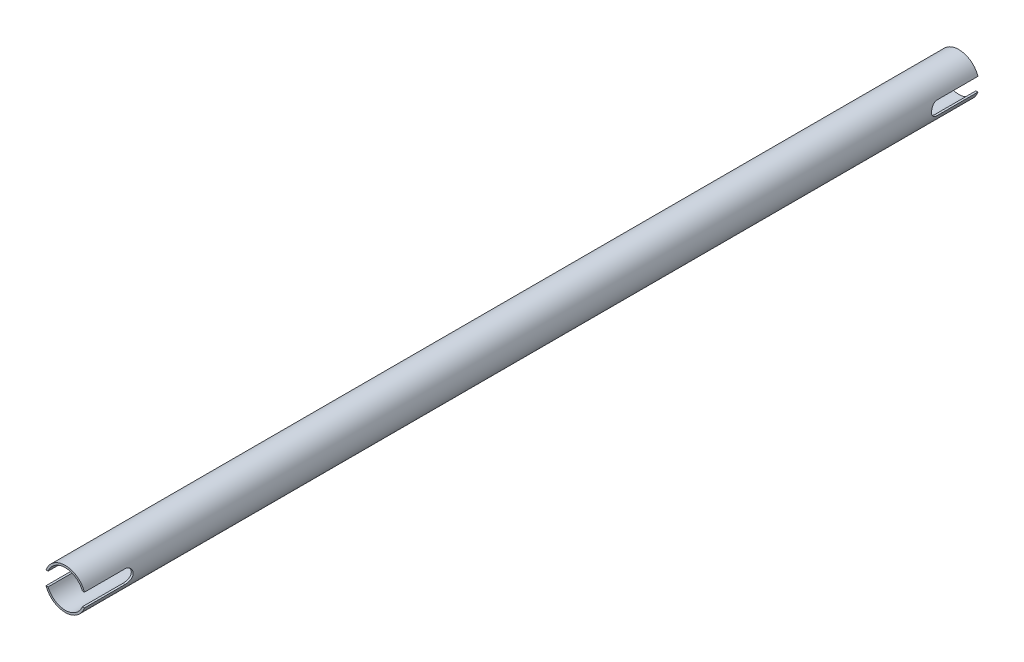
ISO-10303-21;
HEADER;
FILE_DESCRIPTION(('STEP AP214'),'2;1');
FILE_NAME('part.step','',(''),(''),'','','');
FILE_SCHEMA(('AUTOMOTIVE_DESIGN { 1 0 10303 214 1 1 1 1 }'));
ENDSEC;
DATA;
#1=APPLICATION_CONTEXT('core data for automotive mechanical design processes');
#2=APPLICATION_PROTOCOL_DEFINITION('international standard','automotive_design',2000,#1);
#3=PRODUCT_CONTEXT('',#1,'mechanical');
#4=PRODUCT('Part','Part','',(#3));
#5=PRODUCT_RELATED_PRODUCT_CATEGORY('part','',(#4));
#6=PRODUCT_DEFINITION_FORMATION('','',#4);
#7=PRODUCT_DEFINITION_CONTEXT('part definition',#1,'design');
#8=PRODUCT_DEFINITION('design','',#6,#7);
#9=PRODUCT_DEFINITION_SHAPE('','',#8);
#10=(LENGTH_UNIT() NAMED_UNIT(*) SI_UNIT(.MILLI.,.METRE.));
#11=(NAMED_UNIT(*) PLANE_ANGLE_UNIT() SI_UNIT($,.RADIAN.));
#12=(NAMED_UNIT(*) SI_UNIT($,.STERADIAN.) SOLID_ANGLE_UNIT());
#13=UNCERTAINTY_MEASURE_WITH_UNIT(LENGTH_MEASURE(1.E-05),#10,'distance_accuracy_value','');
#14=(GEOMETRIC_REPRESENTATION_CONTEXT(3) GLOBAL_UNCERTAINTY_ASSIGNED_CONTEXT((#13)) GLOBAL_UNIT_ASSIGNED_CONTEXT((#10,
#11,#12)) REPRESENTATION_CONTEXT('',''));
#15=CARTESIAN_POINT('',(0.,0.,0.));
#16=DIRECTION('',(0.,0.,1.));
#17=DIRECTION('',(1.,0.,0.));
#18=AXIS2_PLACEMENT_3D('',#15,#16,#17);
#19=CARTESIAN_POINT('',(0.,0.,0.));
#20=DIRECTION('',(0.,0.,1.));
#21=DIRECTION('',(1.,0.,0.));
#22=AXIS2_PLACEMENT_3D('',#19,#20,#21);
#23=PLANE('',#22);
#24=CARTESIAN_POINT('',(0.,0.,0.));
#25=DIRECTION('',(0.,0.,1.));
#26=DIRECTION('',(1.,0.,0.));
#27=AXIS2_PLACEMENT_3D('',#24,#25,#26);
#28=CIRCLE('',#27,9.525);
#29=CARTESIAN_POINT('',(8.98025612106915,3.175,0.));
#30=VERTEX_POINT('',#29);
#31=CARTESIAN_POINT('',(-8.98025612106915,3.175,0.));
#32=VERTEX_POINT('',#31);
#33=EDGE_CURVE('E176',#30,#32,#28,.T.);
#34=ORIENTED_EDGE('',*,*,#33,.F.);
#35=DIRECTION('',(1.,0.,0.));
#36=VECTOR('',#35,1.);
#37=CARTESIAN_POINT('',(-9.525,3.175,0.));
#38=LINE('',#37,#36);
#39=CARTESIAN_POINT('',(8.00659451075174,3.175,0.));
#40=VERTEX_POINT('',#39);
#41=EDGE_CURVE('E164',#40,#30,#38,.T.);
#42=ORIENTED_EDGE('',*,*,#41,.F.);
#43=CARTESIAN_POINT('',(0.,0.,0.));
#44=DIRECTION('',(0.,0.,1.));
#45=DIRECTION('',(1.,0.,0.));
#46=AXIS2_PLACEMENT_3D('',#43,#44,#45);
#47=CIRCLE('',#46,8.61314);
#48=CARTESIAN_POINT('',(-8.00659451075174,3.175,0.));
#49=VERTEX_POINT('',#48);
#50=EDGE_CURVE('E240',#40,#49,#47,.T.);
#51=ORIENTED_EDGE('',*,*,#50,.T.);
#52=EDGE_CURVE('E450',#32,#49,#38,.T.);
#53=ORIENTED_EDGE('',*,*,#52,.F.);
#54=EDGE_LOOP('',(#34,#42,#51,#53));
#55=FACE_BOUND('',#54,.T.);
#56=ADVANCED_FACE('F42',(#55),#23,.F.);
#57=CARTESIAN_POINT('',(0.,0.,417.195));
#58=DIRECTION('',(0.,0.,1.));
#59=DIRECTION('',(1.,0.,0.));
#60=AXIS2_PLACEMENT_3D('',#57,#58,#59);
#61=PLANE('',#60);
#62=DIRECTION('',(1.,0.,0.));
#63=VECTOR('',#62,1.);
#64=CARTESIAN_POINT('',(-9.525,3.17500000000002,417.195));
#65=LINE('',#64,#63);
#66=CARTESIAN_POINT('',(8.00659451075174,3.17500000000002,417.195));
#67=VERTEX_POINT('',#66);
#68=CARTESIAN_POINT('',(8.98025612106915,3.17500000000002,417.195));
#69=VERTEX_POINT('',#68);
#70=EDGE_CURVE('E290',#67,#69,#65,.T.);
#71=ORIENTED_EDGE('',*,*,#70,.T.);
#72=CARTESIAN_POINT('',(0.,0.,417.195));
#73=DIRECTION('',(0.,0.,1.));
#74=DIRECTION('',(1.,0.,0.));
#75=AXIS2_PLACEMENT_3D('',#72,#73,#74);
#76=CIRCLE('',#75,9.525);
#77=CARTESIAN_POINT('',(-8.98025612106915,3.17500000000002,417.195));
#78=VERTEX_POINT('',#77);
#79=EDGE_CURVE('E188',#69,#78,#76,.T.);
#80=ORIENTED_EDGE('',*,*,#79,.T.);
#81=CARTESIAN_POINT('',(-8.00659451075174,3.17500000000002,417.195));
#82=VERTEX_POINT('',#81);
#83=EDGE_CURVE('E293',#78,#82,#65,.T.);
#84=ORIENTED_EDGE('',*,*,#83,.T.);
#85=CARTESIAN_POINT('',(0.,0.,417.195));
#86=DIRECTION('',(0.,0.,1.));
#87=DIRECTION('',(1.,0.,0.));
#88=AXIS2_PLACEMENT_3D('',#85,#86,#87);
#89=CIRCLE('',#88,8.61314);
#90=EDGE_CURVE('E177',#67,#82,#89,.T.);
#91=ORIENTED_EDGE('',*,*,#90,.F.);
#92=EDGE_LOOP('',(#71,#80,#84,#91));
#93=FACE_BOUND('',#92,.T.);
#94=ADVANCED_FACE('F313',(#93),#61,.T.);
#95=DIRECTION('',(1.,0.,0.));
#96=VECTOR('',#95,1.);
#97=CARTESIAN_POINT('',(-9.525,-3.17499999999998,417.195));
#98=LINE('',#97,#96);
#99=CARTESIAN_POINT('',(-8.98025612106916,-3.17499999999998,417.195));
#100=VERTEX_POINT('',#99);
#101=CARTESIAN_POINT('',(-8.00659451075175,-3.17499999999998,417.195));
#102=VERTEX_POINT('',#101);
#103=EDGE_CURVE('E302',#100,#102,#98,.T.);
#104=ORIENTED_EDGE('',*,*,#103,.F.);
#105=CARTESIAN_POINT('',(8.98025612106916,-3.17499999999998,417.195));
#106=VERTEX_POINT('',#105);
#107=EDGE_CURVE('E180',#100,#106,#76,.T.);
#108=ORIENTED_EDGE('',*,*,#107,.T.);
#109=CARTESIAN_POINT('',(8.00659451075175,-3.17499999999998,417.195));
#110=VERTEX_POINT('',#109);
#111=EDGE_CURVE('E289',#110,#106,#98,.T.);
#112=ORIENTED_EDGE('',*,*,#111,.F.);
#113=EDGE_CURVE('E182',#102,#110,#89,.T.);
#114=ORIENTED_EDGE('',*,*,#113,.F.);
#115=EDGE_LOOP('',(#104,#108,#112,#114));
#116=FACE_BOUND('',#115,.T.);
#117=ADVANCED_FACE('F334',(#116),#61,.T.);
#118=CARTESIAN_POINT('',(-8.98025612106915,-3.175,0.));
#119=VERTEX_POINT('',#118);
#120=CARTESIAN_POINT('',(8.98025612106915,-3.175,0.));
#121=VERTEX_POINT('',#120);
#122=EDGE_CURVE('E169',#119,#121,#28,.T.);
#123=ORIENTED_EDGE('',*,*,#122,.F.);
#124=DIRECTION('',(1.,0.,0.));
#125=VECTOR('',#124,1.);
#126=CARTESIAN_POINT('',(-9.525,-3.175,0.));
#127=LINE('',#126,#125);
#128=CARTESIAN_POINT('',(-8.00659451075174,-3.175,0.));
#129=VERTEX_POINT('',#128);
#130=EDGE_CURVE('E154',#119,#129,#127,.T.);
#131=ORIENTED_EDGE('',*,*,#130,.T.);
#132=CARTESIAN_POINT('',(8.00659451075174,-3.175,0.));
#133=VERTEX_POINT('',#132);
#134=EDGE_CURVE('E239',#129,#133,#47,.T.);
#135=ORIENTED_EDGE('',*,*,#134,.T.);
#136=EDGE_CURVE('E66',#133,#121,#127,.T.);
#137=ORIENTED_EDGE('',*,*,#136,.T.);
#138=EDGE_LOOP('',(#123,#131,#135,#137));
#139=FACE_BOUND('',#138,.T.);
#140=ADVANCED_FACE('F175',(#139),#23,.F.);
#141=CARTESIAN_POINT('',(0.,0.,417.195));
#142=DIRECTION('',(0.,0.,-1.));
#143=DIRECTION('',(-1.,0.,0.));
#144=AXIS2_PLACEMENT_3D('',#141,#142,#143);
#145=CYLINDRICAL_SURFACE('',#144,9.525);
#146=DIRECTION('',(0.,0.,-1.));
#147=VECTOR('',#146,1.);
#148=CARTESIAN_POINT('',(-8.98025612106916,-3.17499999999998,417.195));
#149=LINE('',#148,#147);
#150=CARTESIAN_POINT('',(-8.98025612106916,-3.17499999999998,398.145));
#151=VERTEX_POINT('',#150);
#152=EDGE_CURVE('E229',#100,#151,#149,.T.);
#153=ORIENTED_EDGE('',*,*,#152,.T.);
#154=CARTESIAN_POINT('',(-9.525,0.,401.32));
#155=CARTESIAN_POINT('',(-9.52500048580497,-0.173238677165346,401.320000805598));
#156=CARTESIAN_POINT('',(-9.52023018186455,-0.346472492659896,401.305775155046));
#157=CARTESIAN_POINT('',(-9.50167042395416,-0.687837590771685,401.249422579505));
#158=CARTESIAN_POINT('',(-9.48788003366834,-0.855968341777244,401.207292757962));
#159=CARTESIAN_POINT('',(-9.45277852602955,-1.18215660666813,401.096736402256));
#160=CARTESIAN_POINT('',(-9.43147998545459,-1.34023044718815,401.028353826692));
#161=CARTESIAN_POINT('',(-9.3835361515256,-1.64266542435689,400.867431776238));
#162=CARTESIAN_POINT('',(-9.35688980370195,-1.78702384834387,400.774887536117));
#163=CARTESIAN_POINT('',(-9.30002249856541,-2.06292981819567,400.564903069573));
#164=CARTESIAN_POINT('',(-9.26971591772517,-2.1939367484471,400.446775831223));
#165=CARTESIAN_POINT('',(-9.20941499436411,-2.43469379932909,400.190439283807));
#166=CARTESIAN_POINT('',(-9.17942072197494,-2.54443923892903,400.052225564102));
#167=CARTESIAN_POINT('',(-9.12219830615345,-2.74264419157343,399.754772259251));
#168=CARTESIAN_POINT('',(-9.09507449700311,-2.83040092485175,399.59504237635));
#169=CARTESIAN_POINT('',(-9.04796594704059,-2.97757492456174,399.262040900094));
#170=CARTESIAN_POINT('',(-9.02797902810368,-3.03700083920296,399.088773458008));
#171=CARTESIAN_POINT('',(-8.99830887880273,-3.12379824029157,398.739762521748));
#172=CARTESIAN_POINT('',(-8.98830104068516,-3.15218269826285,398.564299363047));
#173=CARTESIAN_POINT('',(-8.97876209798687,-3.17925806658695,398.210837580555));
#174=CARTESIAN_POINT('',(-8.97922775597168,-3.17795815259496,398.032839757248));
#175=CARTESIAN_POINT('',(-8.99029872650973,-3.14648819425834,397.68800119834));
#176=CARTESIAN_POINT('',(-9.00043970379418,-3.11764017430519,397.521022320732));
#177=CARTESIAN_POINT('',(-9.0289588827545,-3.03404956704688,397.194425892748));
#178=CARTESIAN_POINT('',(-9.04733807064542,-2.97930387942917,397.034809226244));
#179=CARTESIAN_POINT('',(-9.09059367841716,-2.84460650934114,396.724464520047));
#180=CARTESIAN_POINT('',(-9.11556996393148,-2.76426310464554,396.573921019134));
#181=CARTESIAN_POINT('',(-9.16916373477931,-2.58092291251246,396.288034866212));
#182=CARTESIAN_POINT('',(-9.19778227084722,-2.47791958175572,396.152696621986));
#183=CARTESIAN_POINT('',(-9.25726270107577,-2.24583413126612,395.893634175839));
#184=CARTESIAN_POINT('',(-9.28816371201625,-2.1156712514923,395.770885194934));
#185=CARTESIAN_POINT('',(-9.34742029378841,-1.83622813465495,395.548703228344));
#186=CARTESIAN_POINT('',(-9.37577562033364,-1.68694606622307,395.449272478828));
#187=CARTESIAN_POINT('',(-9.42711817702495,-1.37143367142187,395.275764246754));
#188=CARTESIAN_POINT('',(-9.45004936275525,-1.20504990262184,395.201948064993));
#189=CARTESIAN_POINT('',(-9.48755300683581,-0.861279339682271,395.083654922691));
#190=CARTESIAN_POINT('',(-9.50212836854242,-0.68389639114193,395.039167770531));
#191=CARTESIAN_POINT('',(-9.52079715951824,-0.331418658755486,394.982523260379));
#192=CARTESIAN_POINT('',(-9.52531755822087,-0.156557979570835,394.969048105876));
#193=CARTESIAN_POINT('',(-9.52464766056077,0.192960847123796,394.971056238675));
#194=CARTESIAN_POINT('',(-9.51945900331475,0.367619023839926,394.986534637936));
#195=CARTESIAN_POINT('',(-9.50023578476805,0.70650057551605,395.044967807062));
#196=CARTESIAN_POINT('',(-9.48646180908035,0.870879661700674,395.087113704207));
#197=CARTESIAN_POINT('',(-9.45171613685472,1.19016766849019,395.196674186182));
#198=CARTESIAN_POINT('',(-9.43074352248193,1.34507537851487,395.26409199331));
#199=CARTESIAN_POINT('',(-9.38304356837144,1.64556534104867,395.424248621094));
#200=CARTESIAN_POINT('',(-9.3561793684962,1.79079512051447,395.517606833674));
#201=CARTESIAN_POINT('',(-9.29974181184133,2.06395583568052,395.726266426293));
#202=CARTESIAN_POINT('',(-9.27016762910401,2.191881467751,395.841574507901));
#203=CARTESIAN_POINT('',(-9.20993992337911,2.43285171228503,396.097057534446));
#204=CARTESIAN_POINT('',(-9.17929841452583,2.54495607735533,396.238124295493));
#205=CARTESIAN_POINT('',(-9.121774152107,2.74401763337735,396.537724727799));
#206=CARTESIAN_POINT('',(-9.09489142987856,2.83097461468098,396.696258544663));
#207=CARTESIAN_POINT('',(-9.04819093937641,2.97687025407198,397.026361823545));
#208=CARTESIAN_POINT('',(-9.02835890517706,3.03586556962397,397.197904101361));
#209=CARTESIAN_POINT('',(-8.99829392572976,3.12386556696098,397.54930221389));
#210=CARTESIAN_POINT('',(-8.98805665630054,3.15288375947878,397.729154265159));
#211=CARTESIAN_POINT('',(-8.97883201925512,3.17905219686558,398.08212577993));
#212=CARTESIAN_POINT('',(-8.97929370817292,3.17776306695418,398.255116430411));
#213=CARTESIAN_POINT('',(-8.99005281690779,3.1471942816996,398.598279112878));
#214=CARTESIAN_POINT('',(-9.00034965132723,3.11791629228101,398.768451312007));
#215=CARTESIAN_POINT('',(-9.02920864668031,3.03330550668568,399.097930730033));
#216=CARTESIAN_POINT('',(-9.04761011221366,2.97847812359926,399.257382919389));
#217=CARTESIAN_POINT('',(-9.09054566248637,2.8447344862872,399.564947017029));
#218=CARTESIAN_POINT('',(-9.11508110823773,2.76581288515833,399.713056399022));
#219=CARTESIAN_POINT('',(-9.16885482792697,2.58210269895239,400.000735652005));
#220=CARTESIAN_POINT('',(-9.19825159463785,2.47633567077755,400.139650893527));
#221=CARTESIAN_POINT('',(-9.25777156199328,2.24359115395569,400.398265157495));
#222=CARTESIAN_POINT('',(-9.28789496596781,2.11660766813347,400.51795872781));
#223=CARTESIAN_POINT('',(-9.34688346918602,1.83909194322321,400.739433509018));
#224=CARTESIAN_POINT('',(-9.37565377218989,1.68783480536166,400.840334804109));
#225=CARTESIAN_POINT('',(-9.42740021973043,1.36955960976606,401.015169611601));
#226=CARTESIAN_POINT('',(-9.45037784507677,1.20254559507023,401.089110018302));
#227=CARTESIAN_POINT('',(-9.4870751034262,0.865167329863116,401.204816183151));
#228=CARTESIAN_POINT('',(-9.50116249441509,0.695286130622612,401.247871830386));
#229=CARTESIAN_POINT('',(-9.52012342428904,0.350267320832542,401.30545939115));
#230=CARTESIAN_POINT('',(-9.52499950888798,0.175131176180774,401.319999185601));
#231=CARTESIAN_POINT('',(-9.525,0.,401.32));
#232=B_SPLINE_CURVE_WITH_KNOTS('',3,(#154,#155,#156,#157,#158,#159,#160,#161,#162,#163,#164,
#165,#166,#167,#168,#169,#170,#171,#172,#173,#174,#175,#176,#177,#178,#179,#180,#181,#182,#183,
#184,#185,#186,#187,#188,#189,#190,#191,#192,#193,#194,#195,#196,#197,#198,#199,#200,#201,#202,
#203,#204,#205,#206,#207,#208,#209,#210,#211,#212,#213,#214,#215,#216,#217,#218,#219,#220,#221,
#222,#223,#224,#225,#226,#227,#228,#229,#230,#231),.UNSPECIFIED.,.T.,.F.,(4,2,2,2,2,2,2,2,2,2,2,
2,2,2,2,2,2,2,2,2,2,2,2,2,2,2,2,2,2,2,2,2,2,2,2,2,2,2,4),(0.,0.51907156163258,1.03819701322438,
1.55645698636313,2.07481924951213,2.60936372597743,3.14402575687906,3.69406121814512,
4.24392866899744,4.7752611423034,5.30642937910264,5.81332424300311,6.32027980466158,
6.83539943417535,7.35066800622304,7.89283745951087,8.43505888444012,8.98265937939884,
9.53006948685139,10.0537512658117,10.5773446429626,11.0857715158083,11.5942632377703,
12.1161301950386,12.638156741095,13.1839024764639,13.7296527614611,14.274292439,
14.8186865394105,15.3351123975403,15.8515075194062,16.3580948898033,16.8647947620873,
17.3936046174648,17.92256420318,18.4721392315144,19.0215736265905,19.5464607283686,
20.071202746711),.UNSPECIFIED.);
#233=CARTESIAN_POINT('',(-8.98025612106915,3.17500000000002,398.145));
#234=VERTEX_POINT('',#233);
#235=EDGE_CURVE('E228',#151,#234,#232,.T.);
#236=ORIENTED_EDGE('',*,*,#235,.T.);
#237=DIRECTION('',(0.,0.,-1.));
#238=VECTOR('',#237,1.);
#239=CARTESIAN_POINT('',(-8.98025612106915,3.17500000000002,417.195));
#240=LINE('',#239,#238);
#241=EDGE_CURVE('E234',#234,#78,#240,.F.);
#242=ORIENTED_EDGE('',*,*,#241,.T.);
#243=ORIENTED_EDGE('',*,*,#79,.F.);
#244=DIRECTION('',(0.,0.,-1.));
#245=VECTOR('',#244,1.);
#246=CARTESIAN_POINT('',(8.98025612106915,3.17500000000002,417.195));
#247=LINE('',#246,#245);
#248=CARTESIAN_POINT('',(8.98025612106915,3.17500000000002,398.145));
#249=VERTEX_POINT('',#248);
#250=EDGE_CURVE('E237',#69,#249,#247,.T.);
#251=ORIENTED_EDGE('',*,*,#250,.T.);
#252=CARTESIAN_POINT('',(9.525,0.,394.97));
#253=CARTESIAN_POINT('',(9.52500048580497,-0.173238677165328,394.969999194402));
#254=CARTESIAN_POINT('',(9.52023018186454,-0.346472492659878,394.984224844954));
#255=CARTESIAN_POINT('',(9.50167042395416,-0.687837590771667,395.040577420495));
#256=CARTESIAN_POINT('',(9.48788003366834,-0.855968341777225,395.082707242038));
#257=CARTESIAN_POINT('',(9.45277852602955,-1.18215660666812,395.193263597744));
#258=CARTESIAN_POINT('',(9.43147998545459,-1.34023044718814,395.261646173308));
#259=CARTESIAN_POINT('',(9.3835361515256,-1.64266542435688,395.422568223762));
#260=CARTESIAN_POINT('',(9.35688980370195,-1.78702384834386,395.515112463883));
#261=CARTESIAN_POINT('',(9.30002249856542,-2.06292981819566,395.725096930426));
#262=CARTESIAN_POINT('',(9.26971591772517,-2.19393674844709,395.843224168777));
#263=CARTESIAN_POINT('',(9.20941499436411,-2.43469379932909,396.099560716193));
#264=CARTESIAN_POINT('',(9.17942072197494,-2.54443923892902,396.237774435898));
#265=CARTESIAN_POINT('',(9.12219830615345,-2.74264419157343,396.535227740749));
#266=CARTESIAN_POINT('',(9.09507449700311,-2.83040092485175,396.694957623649));
#267=CARTESIAN_POINT('',(9.04796594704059,-2.97757492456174,397.027959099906));
#268=CARTESIAN_POINT('',(9.02797902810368,-3.03700083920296,397.201226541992));
#269=CARTESIAN_POINT('',(8.99830887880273,-3.12379824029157,397.550237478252));
#270=CARTESIAN_POINT('',(8.98830104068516,-3.15218269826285,397.725700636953));
#271=CARTESIAN_POINT('',(8.97876209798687,-3.17925806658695,398.079162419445));
#272=CARTESIAN_POINT('',(8.97922775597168,-3.17795815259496,398.257160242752));
#273=CARTESIAN_POINT('',(8.99029872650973,-3.14648819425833,398.60199880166));
#274=CARTESIAN_POINT('',(9.00043970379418,-3.11764017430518,398.768977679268));
#275=CARTESIAN_POINT('',(9.0289588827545,-3.03404956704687,399.095574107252));
#276=CARTESIAN_POINT('',(9.04733807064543,-2.97930387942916,399.255190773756));
#277=CARTESIAN_POINT('',(9.09059367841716,-2.84460650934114,399.565535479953));
#278=CARTESIAN_POINT('',(9.11556996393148,-2.76426310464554,399.716078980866));
#279=CARTESIAN_POINT('',(9.16916373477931,-2.58092291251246,400.001965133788));
#280=CARTESIAN_POINT('',(9.19778227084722,-2.47791958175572,400.137303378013));
#281=CARTESIAN_POINT('',(9.25726270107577,-2.24583413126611,400.39636582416));
#282=CARTESIAN_POINT('',(9.28816371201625,-2.1156712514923,400.519114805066));
#283=CARTESIAN_POINT('',(9.34742029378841,-1.83622813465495,400.741296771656));
#284=CARTESIAN_POINT('',(9.37577562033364,-1.68694606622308,400.840727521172));
#285=CARTESIAN_POINT('',(9.42711817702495,-1.37143367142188,401.014235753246));
#286=CARTESIAN_POINT('',(9.45004936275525,-1.20504990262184,401.088051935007));
#287=CARTESIAN_POINT('',(9.48755300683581,-0.861279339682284,401.206345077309));
#288=CARTESIAN_POINT('',(9.50212836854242,-0.683896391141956,401.250832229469));
#289=CARTESIAN_POINT('',(9.52079715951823,-0.331418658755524,401.307476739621));
#290=CARTESIAN_POINT('',(9.52531755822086,-0.156557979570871,401.320951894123));
#291=CARTESIAN_POINT('',(9.52464766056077,0.192960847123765,401.318943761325));
#292=CARTESIAN_POINT('',(9.51945900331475,0.367619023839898,401.303465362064));
#293=CARTESIAN_POINT('',(9.50023578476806,0.706500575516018,401.245032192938));
#294=CARTESIAN_POINT('',(9.48646180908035,0.870879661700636,401.202886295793));
#295=CARTESIAN_POINT('',(9.45171613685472,1.19016766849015,401.093325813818));
#296=CARTESIAN_POINT('',(9.43074352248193,1.34507537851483,401.02590800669));
#297=CARTESIAN_POINT('',(9.38304356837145,1.64556534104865,400.865751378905));
#298=CARTESIAN_POINT('',(9.35617936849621,1.79079512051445,400.772393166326));
#299=CARTESIAN_POINT('',(9.29974181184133,2.06395583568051,400.563733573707));
#300=CARTESIAN_POINT('',(9.27016762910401,2.19188146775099,400.448425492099));
#301=CARTESIAN_POINT('',(9.20993992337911,2.43285171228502,400.192942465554));
#302=CARTESIAN_POINT('',(9.17929841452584,2.54495607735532,400.051875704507));
#303=CARTESIAN_POINT('',(9.121774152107,2.74401763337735,399.7522752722));
#304=CARTESIAN_POINT('',(9.09489142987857,2.83097461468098,399.593741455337));
#305=CARTESIAN_POINT('',(9.04819093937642,2.97687025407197,399.263638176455));
#306=CARTESIAN_POINT('',(9.02835890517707,3.03586556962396,399.092095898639));
#307=CARTESIAN_POINT('',(8.99829392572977,3.12386556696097,398.74069778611));
#308=CARTESIAN_POINT('',(8.98805665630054,3.15288375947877,398.560845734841));
#309=CARTESIAN_POINT('',(8.97883201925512,3.17905219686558,398.20787422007));
#310=CARTESIAN_POINT('',(8.97929370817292,3.17776306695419,398.034883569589));
#311=CARTESIAN_POINT('',(8.99005281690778,3.14719428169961,397.691720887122));
#312=CARTESIAN_POINT('',(9.00034965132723,3.11791629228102,397.521548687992));
#313=CARTESIAN_POINT('',(9.02920864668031,3.03330550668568,397.192069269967));
#314=CARTESIAN_POINT('',(9.04761011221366,2.97847812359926,397.032617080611));
#315=CARTESIAN_POINT('',(9.09054566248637,2.8447344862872,396.725052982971));
#316=CARTESIAN_POINT('',(9.11508110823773,2.76581288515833,396.576943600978));
#317=CARTESIAN_POINT('',(9.16885482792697,2.58210269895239,396.289264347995));
#318=CARTESIAN_POINT('',(9.19825159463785,2.47633567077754,396.150349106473));
#319=CARTESIAN_POINT('',(9.25777156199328,2.2435911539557,395.891734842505));
#320=CARTESIAN_POINT('',(9.28789496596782,2.11660766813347,395.77204127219));
#321=CARTESIAN_POINT('',(9.34688346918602,1.8390919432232,395.550566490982));
#322=CARTESIAN_POINT('',(9.37565377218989,1.68783480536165,395.44966519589));
#323=CARTESIAN_POINT('',(9.42740021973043,1.36955960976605,395.274830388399));
#324=CARTESIAN_POINT('',(9.45037784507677,1.20254559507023,395.200889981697));
#325=CARTESIAN_POINT('',(9.4870751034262,0.865167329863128,395.085183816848));
#326=CARTESIAN_POINT('',(9.50116249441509,0.695286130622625,395.042128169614));
#327=CARTESIAN_POINT('',(9.52012342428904,0.350267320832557,394.98454060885));
#328=CARTESIAN_POINT('',(9.52499950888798,0.17513117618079,394.970000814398));
#329=CARTESIAN_POINT('',(9.525,0.,394.97));
#330=B_SPLINE_CURVE_WITH_KNOTS('',3,(#252,#253,#254,#255,#256,#257,#258,#259,#260,#261,#262,
#263,#264,#265,#266,#267,#268,#269,#270,#271,#272,#273,#274,#275,#276,#277,#278,#279,#280,#281,
#282,#283,#284,#285,#286,#287,#288,#289,#290,#291,#292,#293,#294,#295,#296,#297,#298,#299,#300,
#301,#302,#303,#304,#305,#306,#307,#308,#309,#310,#311,#312,#313,#314,#315,#316,#317,#318,#319,
#320,#321,#322,#323,#324,#325,#326,#327,#328,#329),.UNSPECIFIED.,.T.,.F.,(4,2,2,2,2,2,2,2,2,2,2,
2,2,2,2,2,2,2,2,2,2,2,2,2,2,2,2,2,2,2,2,2,2,2,2,2,2,2,4),(0.,0.519071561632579,1.03819701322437,
1.55645698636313,2.07481924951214,2.60936372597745,3.14402575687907,3.69406121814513,
4.24392866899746,4.77526114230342,5.30642937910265,5.81332424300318,6.32027980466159,
6.83539943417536,7.35066800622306,7.89283745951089,8.43505888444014,8.98265937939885,
9.53006948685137,10.0537512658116,10.5773446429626,11.0857715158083,11.5942632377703,
12.1161301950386,12.6381567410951,13.1839024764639,13.7296527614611,14.2742924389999,
14.8186865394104,15.3351123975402,15.8515075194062,16.3580948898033,16.8647947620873,
17.3936046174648,17.92256420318,18.4721392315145,19.0215736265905,19.5464607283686,
20.0712027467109),.UNSPECIFIED.);
#331=CARTESIAN_POINT('',(8.98025612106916,-3.17499999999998,398.145));
#332=VERTEX_POINT('',#331);
#333=EDGE_CURVE('E224',#249,#332,#330,.T.);
#334=ORIENTED_EDGE('',*,*,#333,.T.);
#335=DIRECTION('',(0.,0.,-1.));
#336=VECTOR('',#335,1.);
#337=CARTESIAN_POINT('',(8.98025612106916,-3.17499999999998,417.195));
#338=LINE('',#337,#336);
#339=EDGE_CURVE('E303',#332,#106,#338,.F.);
#340=ORIENTED_EDGE('',*,*,#339,.T.);
#341=ORIENTED_EDGE('',*,*,#107,.F.);
#342=EDGE_LOOP('',(#153,#236,#242,#243,#251,#334,#340,#341));
#343=FACE_BOUND('',#342,.T.);
#344=CARTESIAN_POINT('',(-9.525,0.,22.2249999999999));
#345=CARTESIAN_POINT('',(-9.52500048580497,-0.173238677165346,22.2250008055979));
#346=CARTESIAN_POINT('',(-9.52023018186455,-0.346472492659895,22.210775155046));
#347=CARTESIAN_POINT('',(-9.50167042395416,-0.687837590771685,22.1544225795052));
#348=CARTESIAN_POINT('',(-9.48788003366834,-0.855968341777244,22.112292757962));
#349=CARTESIAN_POINT('',(-9.45277852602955,-1.18215660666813,22.0017364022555));
#350=CARTESIAN_POINT('',(-9.43147998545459,-1.34023044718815,21.9333538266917));
#351=CARTESIAN_POINT('',(-9.3835361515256,-1.64266542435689,21.7724317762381));
#352=CARTESIAN_POINT('',(-9.35688980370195,-1.78702384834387,21.6798875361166));
#353=CARTESIAN_POINT('',(-9.30002249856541,-2.06292981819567,21.4699030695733));
#354=CARTESIAN_POINT('',(-9.26971591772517,-2.1939367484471,21.3517758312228));
#355=CARTESIAN_POINT('',(-9.20941499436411,-2.43469379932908,21.0954392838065));
#356=CARTESIAN_POINT('',(-9.17942072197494,-2.544439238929,20.9572255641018));
#357=CARTESIAN_POINT('',(-9.12219830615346,-2.7426441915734,20.659772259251));
#358=CARTESIAN_POINT('',(-9.09507449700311,-2.83040092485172,20.5000423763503));
#359=CARTESIAN_POINT('',(-9.04796594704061,-2.9775749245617,20.1670409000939));
#360=CARTESIAN_POINT('',(-9.0279790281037,-3.0370008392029,19.9937734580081));
#361=CARTESIAN_POINT('',(-8.99830887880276,-3.1237982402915,19.6447625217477));
#362=CARTESIAN_POINT('',(-8.98830104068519,-3.15218269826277,19.469299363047));
#363=CARTESIAN_POINT('',(-8.9787620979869,-3.17925806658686,19.1158375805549));
#364=CARTESIAN_POINT('',(-8.97922775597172,-3.17795815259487,18.9378397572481));
#365=CARTESIAN_POINT('',(-8.99029872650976,-3.14648819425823,18.59300119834));
#366=CARTESIAN_POINT('',(-9.00043970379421,-3.11764017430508,18.4260223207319));
#367=CARTESIAN_POINT('',(-9.02895888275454,-3.03404956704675,18.0994258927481));
#368=CARTESIAN_POINT('',(-9.04733807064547,-2.97930387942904,17.9398092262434));
#369=CARTESIAN_POINT('',(-9.0905936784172,-2.84460650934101,17.6294645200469));
#370=CARTESIAN_POINT('',(-9.11556996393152,-2.76426310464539,17.4789210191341));
#371=CARTESIAN_POINT('',(-9.16916373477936,-2.58092291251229,17.1930348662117));
#372=CARTESIAN_POINT('',(-9.19778227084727,-2.47791958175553,17.0576966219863));
#373=CARTESIAN_POINT('',(-9.25726270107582,-2.24583413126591,16.7986341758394));
#374=CARTESIAN_POINT('',(-9.28816371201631,-2.11567125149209,16.6758851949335));
#375=CARTESIAN_POINT('',(-9.34742029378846,-1.83622813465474,16.4537032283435));
#376=CARTESIAN_POINT('',(-9.37577562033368,-1.68694606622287,16.3542724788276));
#377=CARTESIAN_POINT('',(-9.42711817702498,-1.37143367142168,16.1807642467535));
#378=CARTESIAN_POINT('',(-9.45004936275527,-1.20504990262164,16.106948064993));
#379=CARTESIAN_POINT('',(-9.48755300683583,-0.861279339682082,15.9886549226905));
#380=CARTESIAN_POINT('',(-9.50212836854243,-0.683896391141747,15.9441677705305));
#381=CARTESIAN_POINT('',(-9.52079715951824,-0.33141865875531,15.8875232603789));
#382=CARTESIAN_POINT('',(-9.52531755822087,-0.156557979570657,15.8740481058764));
#383=CARTESIAN_POINT('',(-9.52464766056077,0.19296084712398,15.876056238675));
#384=CARTESIAN_POINT('',(-9.51945900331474,0.367619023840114,15.891534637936));
#385=CARTESIAN_POINT('',(-9.50023578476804,0.706500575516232,15.9499678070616));
#386=CARTESIAN_POINT('',(-9.48646180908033,0.870879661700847,15.9921137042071));
#387=CARTESIAN_POINT('',(-9.45171613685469,1.19016766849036,16.1016741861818));
#388=CARTESIAN_POINT('',(-9.4307435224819,1.34507537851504,16.1690919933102));
#389=CARTESIAN_POINT('',(-9.38304356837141,1.64556534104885,16.3292486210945));
#390=CARTESIAN_POINT('',(-9.35617936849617,1.79079512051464,16.422606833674));
#391=CARTESIAN_POINT('',(-9.29974181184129,2.06395583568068,16.6312664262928));
#392=CARTESIAN_POINT('',(-9.27016762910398,2.19188146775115,16.7465745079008));
#393=CARTESIAN_POINT('',(-9.20993992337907,2.43285171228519,17.0020575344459));
#394=CARTESIAN_POINT('',(-9.17929841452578,2.5449560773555,17.1431242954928));
#395=CARTESIAN_POINT('',(-9.12177415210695,2.74401763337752,17.4427247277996));
#396=CARTESIAN_POINT('',(-9.09489142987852,2.83097461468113,17.6012585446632));
#397=CARTESIAN_POINT('',(-9.04819093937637,2.9768702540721,17.9313618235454));
#398=CARTESIAN_POINT('',(-9.02835890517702,3.03586556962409,18.1029041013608));
#399=CARTESIAN_POINT('',(-8.99829392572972,3.12386556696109,18.4543022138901));
#400=CARTESIAN_POINT('',(-8.9880566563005,3.15288375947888,18.6341542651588));
#401=CARTESIAN_POINT('',(-8.97883201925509,3.17905219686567,18.9871257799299));
#402=CARTESIAN_POINT('',(-8.97929370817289,3.17776306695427,19.1601164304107));
#403=CARTESIAN_POINT('',(-8.99005281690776,3.14719428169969,19.5032791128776));
#404=CARTESIAN_POINT('',(-9.0003496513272,3.1179162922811,19.6734513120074));
#405=CARTESIAN_POINT('',(-9.02920864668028,3.03330550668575,20.0029307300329));
#406=CARTESIAN_POINT('',(-9.04761011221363,2.97847812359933,20.1623829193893));
#407=CARTESIAN_POINT('',(-9.09054566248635,2.84473448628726,20.469947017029));
#408=CARTESIAN_POINT('',(-9.11508110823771,2.76581288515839,20.6180563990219));
#409=CARTESIAN_POINT('',(-9.16885482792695,2.58210269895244,20.9057356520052));
#410=CARTESIAN_POINT('',(-9.19825159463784,2.47633567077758,21.0446508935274));
#411=CARTESIAN_POINT('',(-9.25777156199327,2.24359115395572,21.3032651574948));
#412=CARTESIAN_POINT('',(-9.28789496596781,2.11660766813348,21.4229587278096));
#413=CARTESIAN_POINT('',(-9.34688346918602,1.83909194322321,21.6444335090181));
#414=CARTESIAN_POINT('',(-9.37565377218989,1.68783480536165,21.7453348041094));
#415=CARTESIAN_POINT('',(-9.42740021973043,1.36955960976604,21.9201696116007));
#416=CARTESIAN_POINT('',(-9.45037784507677,1.20254559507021,21.9941100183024));
#417=CARTESIAN_POINT('',(-9.4870751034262,0.865167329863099,22.1098161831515));
#418=CARTESIAN_POINT('',(-9.50116249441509,0.695286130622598,22.1528718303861));
#419=CARTESIAN_POINT('',(-9.52012342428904,0.350267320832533,22.2104593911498));
#420=CARTESIAN_POINT('',(-9.52499950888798,0.175131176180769,22.2249991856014));
#421=CARTESIAN_POINT('',(-9.525,0.,22.2249999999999));
#422=B_SPLINE_CURVE_WITH_KNOTS('',3,(#344,#345,#346,#347,#348,#349,#350,#351,#352,#353,#354,
#355,#356,#357,#358,#359,#360,#361,#362,#363,#364,#365,#366,#367,#368,#369,#370,#371,#372,#373,
#374,#375,#376,#377,#378,#379,#380,#381,#382,#383,#384,#385,#386,#387,#388,#389,#390,#391,#392,
#393,#394,#395,#396,#397,#398,#399,#400,#401,#402,#403,#404,#405,#406,#407,#408,#409,#410,#411,
#412,#413,#414,#415,#416,#417,#418,#419,#420,#421),.UNSPECIFIED.,.T.,.F.,(4,2,2,2,2,2,2,2,2,2,2,
2,2,2,2,2,2,2,2,2,2,2,2,2,2,2,2,2,2,2,2,2,2,2,2,2,2,2,4),(0.,0.519071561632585,1.03819701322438,
1.55645698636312,2.07481924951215,2.6093637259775,3.14402575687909,3.69406121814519,
4.24392866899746,4.77526114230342,5.30642937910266,5.81332424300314,6.32027980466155,
6.8353994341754,7.35066800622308,7.89283745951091,8.43505888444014,8.98265937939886,
9.53006948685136,10.0537512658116,10.5773446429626,11.0857715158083,11.5942632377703,
12.1161301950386,12.638156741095,13.1839024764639,13.7296527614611,14.274292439,
14.8186865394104,15.3351123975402,15.8515075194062,16.3580948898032,16.8647947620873,
17.3936046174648,17.92256420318,18.4721392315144,19.0215736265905,19.5464607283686,
20.0712027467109),.UNSPECIFIED.);
#423=CARTESIAN_POINT('',(-8.98025612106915,3.175,19.05));
#424=VERTEX_POINT('',#423);
#425=CARTESIAN_POINT('',(-8.98025612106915,-3.175,19.05));
#426=VERTEX_POINT('',#425);
#427=EDGE_CURVE('E171',#424,#426,#422,.T.);
#428=ORIENTED_EDGE('',*,*,#427,.T.);
#429=DIRECTION('',(0.,0.,-1.));
#430=VECTOR('',#429,1.);
#431=CARTESIAN_POINT('',(-8.98025612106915,-3.175,417.195));
#432=LINE('',#431,#430);
#433=EDGE_CURVE('E157',#426,#119,#432,.T.);
#434=ORIENTED_EDGE('',*,*,#433,.T.);
#435=ORIENTED_EDGE('',*,*,#122,.T.);
#436=DIRECTION('',(0.,0.,-1.));
#437=VECTOR('',#436,1.);
#438=CARTESIAN_POINT('',(8.98025612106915,-3.175,417.195));
#439=LINE('',#438,#437);
#440=CARTESIAN_POINT('',(8.98025612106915,-3.175,19.05));
#441=VERTEX_POINT('',#440);
#442=EDGE_CURVE('E173',#121,#441,#439,.F.);
#443=ORIENTED_EDGE('',*,*,#442,.T.);
#444=CARTESIAN_POINT('',(9.525,1.11022302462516E-13,15.8749999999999));
#445=CARTESIAN_POINT('',(9.52500048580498,-0.173238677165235,15.8749991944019));
#446=CARTESIAN_POINT('',(9.52023018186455,-0.346472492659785,15.8892248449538));
#447=CARTESIAN_POINT('',(9.50167042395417,-0.687837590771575,15.9455774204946));
#448=CARTESIAN_POINT('',(9.48788003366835,-0.855968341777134,15.9877072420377));
#449=CARTESIAN_POINT('',(9.45277852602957,-1.18215660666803,16.0982635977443));
#450=CARTESIAN_POINT('',(9.43147998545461,-1.34023044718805,16.1666461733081));
#451=CARTESIAN_POINT('',(9.38353615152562,-1.64266542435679,16.3275682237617));
#452=CARTESIAN_POINT('',(9.35688980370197,-1.78702384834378,16.4201124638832));
#453=CARTESIAN_POINT('',(9.30002249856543,-2.06292981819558,16.6300969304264));
#454=CARTESIAN_POINT('',(9.26971591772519,-2.19393674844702,16.748224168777));
#455=CARTESIAN_POINT('',(9.20941499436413,-2.434693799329,17.0045607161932));
#456=CARTESIAN_POINT('',(9.17942072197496,-2.54443923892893,17.1427744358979));
#457=CARTESIAN_POINT('',(9.12219830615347,-2.74264419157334,17.4402277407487));
#458=CARTESIAN_POINT('',(9.09507449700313,-2.83040092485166,17.5999576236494));
#459=CARTESIAN_POINT('',(9.04796594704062,-2.97757492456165,17.9329590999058));
#460=CARTESIAN_POINT('',(9.02797902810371,-3.03700083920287,18.1062265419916));
#461=CARTESIAN_POINT('',(8.99830887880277,-3.12379824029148,18.455237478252));
#462=CARTESIAN_POINT('',(8.9883010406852,-3.15218269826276,18.6307006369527));
#463=CARTESIAN_POINT('',(8.9787620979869,-3.17925806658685,18.9841624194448));
#464=CARTESIAN_POINT('',(8.97922775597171,-3.17795815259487,19.1621602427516));
#465=CARTESIAN_POINT('',(8.99029872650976,-3.14648819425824,19.5069988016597));
#466=CARTESIAN_POINT('',(9.00043970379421,-3.1176401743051,19.6739776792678));
#467=CARTESIAN_POINT('',(9.02895888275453,-3.03404956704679,20.0005741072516));
#468=CARTESIAN_POINT('',(9.04733807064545,-2.97930387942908,20.1601907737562));
#469=CARTESIAN_POINT('',(9.09059367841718,-2.84460650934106,20.4705354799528));
#470=CARTESIAN_POINT('',(9.11556996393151,-2.76426310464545,20.6210789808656));
#471=CARTESIAN_POINT('',(9.16916373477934,-2.58092291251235,20.906965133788));
#472=CARTESIAN_POINT('',(9.19778227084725,-2.4779195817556,21.0423033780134));
#473=CARTESIAN_POINT('',(9.2572627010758,-2.24583413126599,21.3013658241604));
#474=CARTESIAN_POINT('',(9.28816371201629,-2.11567125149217,21.4241148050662));
#475=CARTESIAN_POINT('',(9.34742029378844,-1.83622813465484,21.6462967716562));
#476=CARTESIAN_POINT('',(9.37577562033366,-1.68694606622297,21.7457275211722));
#477=CARTESIAN_POINT('',(9.42711817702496,-1.37143367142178,21.9192357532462));
#478=CARTESIAN_POINT('',(9.45004936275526,-1.20504990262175,21.9930519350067));
#479=CARTESIAN_POINT('',(9.48755300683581,-0.861279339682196,22.1113450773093));
#480=CARTESIAN_POINT('',(9.50212836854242,-0.683896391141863,22.1558322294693));
#481=CARTESIAN_POINT('',(9.52079715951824,-0.331418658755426,22.2124767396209));
#482=CARTESIAN_POINT('',(9.52531755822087,-0.156557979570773,22.2259518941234));
#483=CARTESIAN_POINT('',(9.52464766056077,0.192960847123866,22.2239437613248));
#484=CARTESIAN_POINT('',(9.51945900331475,0.367619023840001,22.2084653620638));
#485=CARTESIAN_POINT('',(9.50023578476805,0.70650057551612,22.1500321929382));
#486=CARTESIAN_POINT('',(9.48646180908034,0.870879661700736,22.1078862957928));
#487=CARTESIAN_POINT('',(9.45171613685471,1.19016766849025,21.998325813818));
#488=CARTESIAN_POINT('',(9.43074352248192,1.34507537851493,21.9309080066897));
#489=CARTESIAN_POINT('',(9.38304356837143,1.64556534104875,21.7707513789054));
#490=CARTESIAN_POINT('',(9.35617936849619,1.79079512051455,21.6773931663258));
#491=CARTESIAN_POINT('',(9.29974181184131,2.0639558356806,21.4687335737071));
#492=CARTESIAN_POINT('',(9.270167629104,2.19188146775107,21.353425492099));
#493=CARTESIAN_POINT('',(9.20993992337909,2.43285171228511,21.097942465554));
#494=CARTESIAN_POINT('',(9.1792984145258,2.54495607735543,20.9568757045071));
#495=CARTESIAN_POINT('',(9.12177415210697,2.74401763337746,20.6572752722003));
#496=CARTESIAN_POINT('',(9.09489142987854,2.83097461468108,20.4987414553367));
#497=CARTESIAN_POINT('',(9.04819093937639,2.97687025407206,20.1686381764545));
#498=CARTESIAN_POINT('',(9.02835890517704,3.03586556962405,19.9970958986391));
#499=CARTESIAN_POINT('',(8.99829392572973,3.12386556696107,19.6456977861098));
#500=CARTESIAN_POINT('',(8.98805665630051,3.15288375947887,19.4658457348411));
#501=CARTESIAN_POINT('',(8.97883201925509,3.17905219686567,19.11287422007));
#502=CARTESIAN_POINT('',(8.97929370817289,3.17776306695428,18.9398835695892));
#503=CARTESIAN_POINT('',(8.99005281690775,3.14719428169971,18.5967208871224));
#504=CARTESIAN_POINT('',(9.00034965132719,3.11791629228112,18.4265486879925));
#505=CARTESIAN_POINT('',(9.02920864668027,3.03330550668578,18.0970692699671));
#506=CARTESIAN_POINT('',(9.04761011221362,2.97847812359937,17.9376170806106));
#507=CARTESIAN_POINT('',(9.09054566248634,2.84473448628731,17.6300529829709));
#508=CARTESIAN_POINT('',(9.1150811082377,2.76581288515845,17.481943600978));
#509=CARTESIAN_POINT('',(9.16885482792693,2.58210269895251,17.1942643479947));
#510=CARTESIAN_POINT('',(9.19825159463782,2.47633567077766,17.0553491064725));
#511=CARTESIAN_POINT('',(9.25777156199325,2.2435911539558,16.7967348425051));
#512=CARTESIAN_POINT('',(9.28789496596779,2.11660766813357,16.6770412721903));
#513=CARTESIAN_POINT('',(9.346883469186,1.8390919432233,16.4555664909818));
#514=CARTESIAN_POINT('',(9.37565377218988,1.68783480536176,16.3546651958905));
#515=CARTESIAN_POINT('',(9.42740021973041,1.36955960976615,16.1798303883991));
#516=CARTESIAN_POINT('',(9.45037784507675,1.20254559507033,16.1058899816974));
#517=CARTESIAN_POINT('',(9.48707510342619,0.865167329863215,15.9901838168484));
#518=CARTESIAN_POINT('',(9.50116249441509,0.695286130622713,15.9471281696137));
#519=CARTESIAN_POINT('',(9.52012342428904,0.350267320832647,15.88954060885));
#520=CARTESIAN_POINT('',(9.52499950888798,0.175131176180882,15.8750008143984));
#521=CARTESIAN_POINT('',(9.525,1.11022302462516E-13,15.8749999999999));
#522=B_SPLINE_CURVE_WITH_KNOTS('',3,(#444,#445,#446,#447,#448,#449,#450,#451,#452,#453,#454,
#455,#456,#457,#458,#459,#460,#461,#462,#463,#464,#465,#466,#467,#468,#469,#470,#471,#472,#473,
#474,#475,#476,#477,#478,#479,#480,#481,#482,#483,#484,#485,#486,#487,#488,#489,#490,#491,#492,
#493,#494,#495,#496,#497,#498,#499,#500,#501,#502,#503,#504,#505,#506,#507,#508,#509,#510,#511,
#512,#513,#514,#515,#516,#517,#518,#519,#520,#521),.UNSPECIFIED.,.T.,.F.,(4,2,2,2,2,2,2,2,2,2,2,
2,2,2,2,2,2,2,2,2,2,2,2,2,2,2,2,2,2,2,2,2,2,2,2,2,2,2,4),(0.,0.519071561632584,1.03819701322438,
1.55645698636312,2.07481924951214,2.6093637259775,3.14402575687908,3.69406121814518,
4.24392866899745,4.77526114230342,5.30642937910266,5.81332424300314,6.32027980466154,
6.83539943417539,7.35066800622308,7.8928374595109,8.43505888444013,8.98265937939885,
9.53006948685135,10.0537512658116,10.5773446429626,11.0857715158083,11.5942632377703,
12.1161301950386,12.638156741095,13.1839024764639,13.7296527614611,14.274292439,
14.8186865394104,15.3351123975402,15.8515075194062,16.3580948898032,16.8647947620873,
17.3936046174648,17.92256420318,18.4721392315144,19.0215736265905,19.5464607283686,
20.0712027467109),.UNSPECIFIED.);
#523=CARTESIAN_POINT('',(8.98025612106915,3.175,19.05));
#524=VERTEX_POINT('',#523);
#525=EDGE_CURVE('E280',#441,#524,#522,.T.);
#526=ORIENTED_EDGE('',*,*,#525,.T.);
#527=DIRECTION('',(0.,0.,-1.));
#528=VECTOR('',#527,1.);
#529=CARTESIAN_POINT('',(8.98025612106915,3.175,417.195));
#530=LINE('',#529,#528);
#531=EDGE_CURVE('E284',#524,#30,#530,.T.);
#532=ORIENTED_EDGE('',*,*,#531,.T.);
#533=ORIENTED_EDGE('',*,*,#33,.T.);
#534=DIRECTION('',(0.,0.,-1.));
#535=VECTOR('',#534,1.);
#536=CARTESIAN_POINT('',(-8.98025612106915,3.175,417.195));
#537=LINE('',#536,#535);
#538=EDGE_CURVE('E172',#32,#424,#537,.F.);
#539=ORIENTED_EDGE('',*,*,#538,.T.);
#540=EDGE_LOOP('',(#428,#434,#435,#443,#526,#532,#533,#539));
#541=FACE_BOUND('',#540,.T.);
#542=ADVANCED_FACE('F44',(#343,#541),#145,.T.);
#543=CARTESIAN_POINT('',(0.,0.,417.195));
#544=DIRECTION('',(0.,0.,-1.));
#545=DIRECTION('',(-1.,0.,0.));
#546=AXIS2_PLACEMENT_3D('',#543,#544,#545);
#547=CYLINDRICAL_SURFACE('',#546,8.61314);
#548=DIRECTION('',(0.,0.,-1.));
#549=VECTOR('',#548,1.);
#550=CARTESIAN_POINT('',(-8.00659451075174,3.175,417.195));
#551=LINE('',#550,#549);
#552=CARTESIAN_POINT('',(-8.00659451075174,3.175,19.05));
#553=VERTEX_POINT('',#552);
#554=EDGE_CURVE('E12',#49,#553,#551,.F.);
#555=ORIENTED_EDGE('',*,*,#554,.F.);
#556=ORIENTED_EDGE('',*,*,#50,.F.);
#557=DIRECTION('',(0.,0.,-1.));
#558=VECTOR('',#557,1.);
#559=CARTESIAN_POINT('',(8.00659451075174,3.175,417.195));
#560=LINE('',#559,#558);
#561=CARTESIAN_POINT('',(8.00659451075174,3.175,19.05));
#562=VERTEX_POINT('',#561);
#563=EDGE_CURVE('E259',#562,#40,#560,.T.);
#564=ORIENTED_EDGE('',*,*,#563,.F.);
#565=CARTESIAN_POINT('',(8.61314,1.11022302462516E-13,15.8749999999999));
#566=CARTESIAN_POINT('',(8.61314383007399,-0.172153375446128,15.8749948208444));
#567=CARTESIAN_POINT('',(8.60793332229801,-0.344270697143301,15.8890457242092));
#568=CARTESIAN_POINT('',(8.58766702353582,-0.683372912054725,15.9446596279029));
#569=CARTESIAN_POINT('',(8.5726122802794,-0.850358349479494,15.9862197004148));
#570=CARTESIAN_POINT('',(8.53427670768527,-1.17425809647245,16.095190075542));
#571=CARTESIAN_POINT('',(8.51101142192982,-1.33119077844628,16.1625515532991));
#572=CARTESIAN_POINT('',(8.45858102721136,-1.6315199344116,16.3209686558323));
#573=CARTESIAN_POINT('',(8.42941439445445,-1.77491289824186,16.4120304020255));
#574=CARTESIAN_POINT('',(8.36685718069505,-2.05000690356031,16.6191898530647));
#575=CARTESIAN_POINT('',(8.33334986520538,-2.18107494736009,16.736092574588));
#576=CARTESIAN_POINT('',(8.26647265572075,-2.42225155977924,16.9899063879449));
#577=CARTESIAN_POINT('',(8.23310280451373,-2.53235402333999,17.1268232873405));
#578=CARTESIAN_POINT('',(8.16893265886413,-2.73243196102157,17.422885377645));
#579=CARTESIAN_POINT('',(8.13827085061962,-2.82152476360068,17.5826600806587));
#580=CARTESIAN_POINT('',(8.08479822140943,-2.97129428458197,17.9162348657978));
#581=CARTESIAN_POINT('',(8.06198438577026,-3.03198191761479,18.0900295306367));
#582=CARTESIAN_POINT('',(8.0280357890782,-3.12073904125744,18.4394358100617));
#583=CARTESIAN_POINT('',(8.01647134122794,-3.1500134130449,18.6146982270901));
#584=CARTESIAN_POINT('',(8.00507114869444,-3.17888055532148,18.967999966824));
#585=CARTESIAN_POINT('',(8.00523076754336,-3.17848505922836,19.1460381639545));
#586=CARTESIAN_POINT('',(8.01688920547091,-3.14894724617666,19.4889395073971));
#587=CARTESIAN_POINT('',(8.02773530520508,-3.12145965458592,19.653971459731));
#588=CARTESIAN_POINT('',(8.05846253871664,-3.04124766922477,19.9768905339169));
#589=CARTESIAN_POINT('',(8.07834498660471,-2.98851960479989,20.134776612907));
#590=CARTESIAN_POINT('',(8.12530884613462,-2.85838775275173,20.4423556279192));
#591=CARTESIAN_POINT('',(8.15251670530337,-2.78054525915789,20.5918427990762));
#592=CARTESIAN_POINT('',(8.21102191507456,-2.60269971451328,20.8761200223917));
#593=CARTESIAN_POINT('',(8.24232064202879,-2.50268919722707,21.0109050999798));
#594=CARTESIAN_POINT('',(8.30795474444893,-2.27571624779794,21.2711347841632));
#595=CARTESIAN_POINT('',(8.34235550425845,-2.14742774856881,21.3954090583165));
#596=CARTESIAN_POINT('',(8.40857008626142,-1.87142961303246,21.6210211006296));
#597=CARTESIAN_POINT('',(8.44038353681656,-1.72371719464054,21.7223555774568));
#598=CARTESIAN_POINT('',(8.49843399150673,-1.41016020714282,21.9004443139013));
#599=CARTESIAN_POINT('',(8.52458350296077,-1.24408389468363,21.9768210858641));
#600=CARTESIAN_POINT('',(8.56771330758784,-0.900237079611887,22.1001670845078));
#601=CARTESIAN_POINT('',(8.5846975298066,-0.722471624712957,22.1471489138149));
#602=CARTESIAN_POINT('',(8.6068987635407,-0.370151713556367,22.208149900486));
#603=CARTESIAN_POINT('',(8.61267810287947,-0.195905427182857,22.2237458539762));
#604=CARTESIAN_POINT('',(8.61354793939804,0.152789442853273,22.2261077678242));
#605=CARTESIAN_POINT('',(8.60864071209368,0.327237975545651,22.2128798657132));
#606=CARTESIAN_POINT('',(8.58906010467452,0.664652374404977,22.1591766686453));
#607=CARTESIAN_POINT('',(8.57475343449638,0.827804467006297,22.11972385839));
#608=CARTESIAN_POINT('',(8.53818028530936,1.14506708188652,22.0160261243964));
#609=CARTESIAN_POINT('',(8.51591277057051,1.29917642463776,21.9517779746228));
#610=CARTESIAN_POINT('',(8.46482409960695,1.59898125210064,21.7982844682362));
#611=CARTESIAN_POINT('',(8.43583166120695,1.74430328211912,21.7083684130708));
#612=CARTESIAN_POINT('',(8.37451402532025,2.01827569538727,21.5068539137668));
#613=CARTESIAN_POINT('',(8.34218762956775,2.14692004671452,21.3952476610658));
#614=CARTESIAN_POINT('',(8.27552156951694,2.39141806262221,21.1461571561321));
#615=CARTESIAN_POINT('',(8.24117057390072,2.50615140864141,21.007573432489));
#616=CARTESIAN_POINT('',(8.17609648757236,2.7109421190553,20.7124314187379));
#617=CARTESIAN_POINT('',(8.14537366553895,2.80099765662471,20.5558717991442));
#618=CARTESIAN_POINT('',(8.09119739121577,2.95386839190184,20.2281581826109));
#619=CARTESIAN_POINT('',(8.06776578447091,3.01660194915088,20.0569622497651));
#620=CARTESIAN_POINT('',(8.03147217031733,3.11195904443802,19.7053374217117));
#621=CARTESIAN_POINT('',(8.01860392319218,3.14460035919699,19.5249140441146));
#622=CARTESIAN_POINT('',(8.0057045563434,3.17728725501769,19.1720488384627));
#623=CARTESIAN_POINT('',(8.00492439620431,3.17923491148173,18.9998090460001));
#624=CARTESIAN_POINT('',(8.01438000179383,3.15532184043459,18.6575954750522));
#625=CARTESIAN_POINT('',(8.02461479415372,3.12946357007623,18.4876214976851));
#626=CARTESIAN_POINT('',(8.05433347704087,3.05213401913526,18.1596659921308));
#627=CARTESIAN_POINT('',(8.07354559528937,3.00141332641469,18.0014807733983));
#628=CARTESIAN_POINT('',(8.11890452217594,2.87645038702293,17.6957670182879));
#629=CARTESIAN_POINT('',(8.14505305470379,2.8022022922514,17.548241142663));
#630=CARTESIAN_POINT('',(8.20300217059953,2.62788346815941,17.2598385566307));
#631=CARTESIAN_POINT('',(8.23502335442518,2.52668671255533,17.1196872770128));
#632=CARTESIAN_POINT('',(8.30032588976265,2.30311121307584,16.8577465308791));
#633=CARTESIAN_POINT('',(8.33360763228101,2.18072585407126,16.7359628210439));
#634=CARTESIAN_POINT('',(8.39974303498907,1.91069725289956,16.5078211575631));
#635=CARTESIAN_POINT('',(8.4324861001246,1.76207691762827,16.4025826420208));
#636=CARTESIAN_POINT('',(8.4920338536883,1.44811730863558,16.2186261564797));
#637=CARTESIAN_POINT('',(8.51883841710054,1.28277768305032,16.1399087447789));
#638=CARTESIAN_POINT('',(8.56409749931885,0.934888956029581,16.0099247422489));
#639=CARTESIAN_POINT('',(8.58228639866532,0.751979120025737,15.9595234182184));
#640=CARTESIAN_POINT('',(8.60680281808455,0.37936283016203,15.8920715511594));
#641=CARTESIAN_POINT('',(8.61313578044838,0.1896595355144,15.8750057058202));
#642=CARTESIAN_POINT('',(8.61314,1.11022302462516E-13,15.8749999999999));
#643=B_SPLINE_CURVE_WITH_KNOTS('',3,(#565,#566,#567,#568,#569,#570,#571,#572,#573,#574,#575,
#576,#577,#578,#579,#580,#581,#582,#583,#584,#585,#586,#587,#588,#589,#590,#591,#592,#593,#594,
#595,#596,#597,#598,#599,#600,#601,#602,#603,#604,#605,#606,#607,#608,#609,#610,#611,#612,#613,
#614,#615,#616,#617,#618,#619,#620,#621,#622,#623,#624,#625,#626,#627,#628,#629,#630,#631,#632,
#633,#634,#635,#636,#637,#638,#639,#640,#641,#642),.UNSPECIFIED.,.T.,.F.,(4,2,2,2,2,2,2,2,2,2,2,
2,2,2,2,2,2,2,2,2,2,2,2,2,2,2,2,2,2,2,2,2,2,2,2,2,2,2,4),(0.,0.5157608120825,1.03146674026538,
1.5462015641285,2.06106946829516,2.59508182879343,3.12924945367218,3.68293984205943,
4.23641730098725,4.76781035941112,5.29899327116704,5.79962439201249,6.30032834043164,
6.81030084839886,7.32044537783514,7.86363018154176,8.4068928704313,8.95802830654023,
9.50892728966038,10.0313800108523,10.5537214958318,11.0568062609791,11.5599565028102,
12.0776936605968,12.5956175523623,13.1425568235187,13.6895365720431,14.2381397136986,
14.7864185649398,15.3005770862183,15.8146901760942,16.3141583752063,16.813750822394,
17.3388825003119,17.8641784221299,18.416564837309,18.9689628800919,19.5374320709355,
20.1056402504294),.UNSPECIFIED.);
#644=CARTESIAN_POINT('',(8.00659451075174,-3.175,19.05));
#645=VERTEX_POINT('',#644);
#646=EDGE_CURVE('E254',#645,#562,#643,.T.);
#647=ORIENTED_EDGE('',*,*,#646,.F.);
#648=DIRECTION('',(0.,0.,-1.));
#649=VECTOR('',#648,1.);
#650=CARTESIAN_POINT('',(8.00659451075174,-3.175,417.195));
#651=LINE('',#650,#649);
#652=EDGE_CURVE('E252',#133,#645,#651,.F.);
#653=ORIENTED_EDGE('',*,*,#652,.F.);
#654=ORIENTED_EDGE('',*,*,#134,.F.);
#655=DIRECTION('',(0.,0.,-1.));
#656=VECTOR('',#655,1.);
#657=CARTESIAN_POINT('',(-8.00659451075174,-3.175,417.195));
#658=LINE('',#657,#656);
#659=CARTESIAN_POINT('',(-8.00659451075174,-3.175,19.05));
#660=VERTEX_POINT('',#659);
#661=EDGE_CURVE('E159',#660,#129,#658,.T.);
#662=ORIENTED_EDGE('',*,*,#661,.F.);
#663=CARTESIAN_POINT('',(-8.61314,0.,22.2249999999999));
#664=CARTESIAN_POINT('',(-8.61314383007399,-0.17215337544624,22.2250051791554));
#665=CARTESIAN_POINT('',(-8.60793332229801,-0.344270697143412,22.2109542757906));
#666=CARTESIAN_POINT('',(-8.58766702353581,-0.683372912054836,22.1553403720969));
#667=CARTESIAN_POINT('',(-8.57261228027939,-0.850358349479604,22.113780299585));
#668=CARTESIAN_POINT('',(-8.53427670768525,-1.17425809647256,22.0048099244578));
#669=CARTESIAN_POINT('',(-8.51101142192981,-1.33119077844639,21.9374484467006));
#670=CARTESIAN_POINT('',(-8.45858102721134,-1.6315199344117,21.7790313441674));
#671=CARTESIAN_POINT('',(-8.42941439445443,-1.77491289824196,21.6879695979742));
#672=CARTESIAN_POINT('',(-8.36685718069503,-2.0500069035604,21.4808101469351));
#673=CARTESIAN_POINT('',(-8.33334986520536,-2.18107494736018,21.3639074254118));
#674=CARTESIAN_POINT('',(-8.26647265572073,-2.42225155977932,21.1100936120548));
#675=CARTESIAN_POINT('',(-8.23310280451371,-2.53235402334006,20.9731767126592));
#676=CARTESIAN_POINT('',(-8.16893265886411,-2.73243196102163,20.6771146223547));
#677=CARTESIAN_POINT('',(-8.13827085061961,-2.82152476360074,20.517339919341));
#678=CARTESIAN_POINT('',(-8.08479822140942,-2.97129428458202,20.1837651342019));
#679=CARTESIAN_POINT('',(-8.06198438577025,-3.03198191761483,20.009970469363));
#680=CARTESIAN_POINT('',(-8.02803578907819,-3.12073904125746,19.660564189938));
#681=CARTESIAN_POINT('',(-8.01647134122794,-3.15001341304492,19.4853017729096));
#682=CARTESIAN_POINT('',(-8.00507114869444,-3.17888055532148,19.1320000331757));
#683=CARTESIAN_POINT('',(-8.00523076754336,-3.17848505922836,18.9539618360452));
#684=CARTESIAN_POINT('',(-8.01688920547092,-3.14894724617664,18.6110604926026));
#685=CARTESIAN_POINT('',(-8.02773530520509,-3.1214596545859,18.4460285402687));
#686=CARTESIAN_POINT('',(-8.05846253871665,-3.04124766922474,18.1231094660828));
#687=CARTESIAN_POINT('',(-8.07834498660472,-2.98851960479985,17.9652233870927));
#688=CARTESIAN_POINT('',(-8.12530884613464,-2.85838775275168,17.6576443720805));
#689=CARTESIAN_POINT('',(-8.15251670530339,-2.78054525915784,17.5081572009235));
#690=CARTESIAN_POINT('',(-8.21102191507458,-2.60269971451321,17.223879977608));
#691=CARTESIAN_POINT('',(-8.24232064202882,-2.502689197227,17.0890949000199));
#692=CARTESIAN_POINT('',(-8.30795474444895,-2.27571624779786,16.8288652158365));
#693=CARTESIAN_POINT('',(-8.34235550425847,-2.14742774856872,16.7045909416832));
#694=CARTESIAN_POINT('',(-8.40857008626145,-1.87142961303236,16.4789788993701));
#695=CARTESIAN_POINT('',(-8.44038353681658,-1.72371719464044,16.3776444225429));
#696=CARTESIAN_POINT('',(-8.49843399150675,-1.4101602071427,16.1995556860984));
#697=CARTESIAN_POINT('',(-8.52458350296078,-1.24408389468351,16.1231789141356));
#698=CARTESIAN_POINT('',(-8.56771330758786,-0.900237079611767,15.999832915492));
#699=CARTESIAN_POINT('',(-8.58469752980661,-0.722471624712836,15.9528510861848));
#700=CARTESIAN_POINT('',(-8.60689876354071,-0.370151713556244,15.8918500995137));
#701=CARTESIAN_POINT('',(-8.61267810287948,-0.195905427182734,15.8762541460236));
#702=CARTESIAN_POINT('',(-8.61354793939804,0.152789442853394,15.8738922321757));
#703=CARTESIAN_POINT('',(-8.60864071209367,0.327237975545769,15.8871201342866));
#704=CARTESIAN_POINT('',(-8.58906010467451,0.66465237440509,15.9408233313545));
#705=CARTESIAN_POINT('',(-8.57475343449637,0.827804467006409,15.9802761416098));
#706=CARTESIAN_POINT('',(-8.53818028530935,1.14506708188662,16.0839738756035));
#707=CARTESIAN_POINT('',(-8.5159127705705,1.29917642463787,16.1482220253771));
#708=CARTESIAN_POINT('',(-8.46482409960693,1.59898125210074,16.3017155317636));
#709=CARTESIAN_POINT('',(-8.43583166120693,1.74430328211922,16.391631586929));
#710=CARTESIAN_POINT('',(-8.37451402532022,2.01827569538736,16.5931460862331));
#711=CARTESIAN_POINT('',(-8.34218762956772,2.14692004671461,16.7047523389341));
#712=CARTESIAN_POINT('',(-8.27552156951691,2.39141806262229,16.9538428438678));
#713=CARTESIAN_POINT('',(-8.24117057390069,2.50615140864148,17.0924265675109));
#714=CARTESIAN_POINT('',(-8.17609648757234,2.71094211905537,17.387568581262));
#715=CARTESIAN_POINT('',(-8.14537366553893,2.80099765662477,17.5441282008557));
#716=CARTESIAN_POINT('',(-8.09119739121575,2.95386839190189,17.8718418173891));
#717=CARTESIAN_POINT('',(-8.06776578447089,3.01660194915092,18.0430377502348));
#718=CARTESIAN_POINT('',(-8.03147217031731,3.11195904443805,18.3946625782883));
#719=CARTESIAN_POINT('',(-8.01860392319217,3.14460035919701,18.5750859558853));
#720=CARTESIAN_POINT('',(-8.0057045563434,3.17728725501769,18.9279511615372));
#721=CARTESIAN_POINT('',(-8.00492439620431,3.17923491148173,19.1001909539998));
#722=CARTESIAN_POINT('',(-8.01438000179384,3.15532184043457,19.4424045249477));
#723=CARTESIAN_POINT('',(-8.02461479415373,3.12946357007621,19.6123785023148));
#724=CARTESIAN_POINT('',(-8.05433347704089,3.05213401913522,19.9403340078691));
#725=CARTESIAN_POINT('',(-8.07354559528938,3.00141332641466,20.0985192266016));
#726=CARTESIAN_POINT('',(-8.11890452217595,2.87645038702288,20.404232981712));
#727=CARTESIAN_POINT('',(-8.14505305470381,2.80220229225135,20.5517588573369));
#728=CARTESIAN_POINT('',(-8.20300217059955,2.62788346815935,20.8401614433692));
#729=CARTESIAN_POINT('',(-8.2350233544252,2.52668671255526,20.9803127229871));
#730=CARTESIAN_POINT('',(-8.30032588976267,2.30311121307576,21.2422534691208));
#731=CARTESIAN_POINT('',(-8.33360763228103,2.18072585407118,21.3640371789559));
#732=CARTESIAN_POINT('',(-8.39974303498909,1.91069725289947,21.5921788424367));
#733=CARTESIAN_POINT('',(-8.43248610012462,1.76207691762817,21.6974173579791));
#734=CARTESIAN_POINT('',(-8.49203385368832,1.44811730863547,21.8813738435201));
#735=CARTESIAN_POINT('',(-8.51883841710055,1.2827776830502,21.9600912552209));
#736=CARTESIAN_POINT('',(-8.56409749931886,0.934888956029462,22.0900752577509));
#737=CARTESIAN_POINT('',(-8.58228639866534,0.751979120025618,22.1404765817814));
#738=CARTESIAN_POINT('',(-8.60680281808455,0.379362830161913,22.2079284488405));
#739=CARTESIAN_POINT('',(-8.61313578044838,0.189659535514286,22.2249942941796));
#740=CARTESIAN_POINT('',(-8.61314,0.,22.2249999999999));
#741=B_SPLINE_CURVE_WITH_KNOTS('',3,(#663,#664,#665,#666,#667,#668,#669,#670,#671,#672,#673,
#674,#675,#676,#677,#678,#679,#680,#681,#682,#683,#684,#685,#686,#687,#688,#689,#690,#691,#692,
#693,#694,#695,#696,#697,#698,#699,#700,#701,#702,#703,#704,#705,#706,#707,#708,#709,#710,#711,
#712,#713,#714,#715,#716,#717,#718,#719,#720,#721,#722,#723,#724,#725,#726,#727,#728,#729,#730,
#731,#732,#733,#734,#735,#736,#737,#738,#739,#740),.UNSPECIFIED.,.T.,.F.,(4,2,2,2,2,2,2,2,2,2,2,
2,2,2,2,2,2,2,2,2,2,2,2,2,2,2,2,2,2,2,2,2,2,2,2,2,2,2,4),(0.,0.515760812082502,1.03146674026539,
1.54620156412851,2.06106946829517,2.59508182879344,3.1292494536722,3.68293984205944,
4.23641730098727,4.76781035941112,5.29899327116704,5.79962439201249,6.30032834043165,
6.81030084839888,7.32044537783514,7.86363018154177,8.40689287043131,8.95802830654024,
9.5089272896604,10.0313800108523,10.5537214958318,11.0568062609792,11.5599565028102,
12.0776936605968,12.5956175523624,13.1425568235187,13.6895365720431,14.2381397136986,
14.7864185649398,15.3005770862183,15.8146901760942,16.3141583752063,16.813750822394,
17.3388825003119,17.8641784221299,18.416564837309,18.9689628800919,19.5374320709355,
20.1056402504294),.UNSPECIFIED.);
#742=EDGE_CURVE('E51',#553,#660,#741,.T.);
#743=ORIENTED_EDGE('',*,*,#742,.F.);
#744=EDGE_LOOP('',(#555,#556,#564,#647,#653,#654,#662,#743));
#745=FACE_BOUND('',#744,.T.);
#746=DIRECTION('',(0.,0.,-1.));
#747=VECTOR('',#746,1.);
#748=CARTESIAN_POINT('',(-8.00659451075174,3.17500000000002,417.195));
#749=LINE('',#748,#747);
#750=CARTESIAN_POINT('',(-8.00659451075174,3.17500000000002,398.145));
#751=VERTEX_POINT('',#750);
#752=EDGE_CURVE('E257',#751,#82,#749,.F.);
#753=ORIENTED_EDGE('',*,*,#752,.F.);
#754=CARTESIAN_POINT('',(-8.61314,0.,401.32));
#755=CARTESIAN_POINT('',(-8.61314383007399,-0.17215337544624,401.320005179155));
#756=CARTESIAN_POINT('',(-8.60793332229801,-0.344270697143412,401.305954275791));
#757=CARTESIAN_POINT('',(-8.58766702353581,-0.683372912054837,401.250340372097));
#758=CARTESIAN_POINT('',(-8.57261228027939,-0.850358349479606,401.208780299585));
#759=CARTESIAN_POINT('',(-8.53427670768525,-1.17425809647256,401.099809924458));
#760=CARTESIAN_POINT('',(-8.51101142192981,-1.33119077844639,401.032448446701));
#761=CARTESIAN_POINT('',(-8.45858102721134,-1.63151993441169,400.874031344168));
#762=CARTESIAN_POINT('',(-8.42941439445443,-1.77491289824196,400.782969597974));
#763=CARTESIAN_POINT('',(-8.36685718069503,-2.0500069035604,400.575810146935));
#764=CARTESIAN_POINT('',(-8.33334986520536,-2.18107494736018,400.458907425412));
#765=CARTESIAN_POINT('',(-8.26647265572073,-2.42225155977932,400.205093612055));
#766=CARTESIAN_POINT('',(-8.23310280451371,-2.53235402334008,400.068176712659));
#767=CARTESIAN_POINT('',(-8.16893265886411,-2.73243196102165,399.772114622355));
#768=CARTESIAN_POINT('',(-8.13827085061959,-2.82152476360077,399.612339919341));
#769=CARTESIAN_POINT('',(-8.0847982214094,-2.97129428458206,399.278765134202));
#770=CARTESIAN_POINT('',(-8.06198438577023,-3.03198191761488,399.104970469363));
#771=CARTESIAN_POINT('',(-8.02803578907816,-3.12073904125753,398.755564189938));
#772=CARTESIAN_POINT('',(-8.01647134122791,-3.15001341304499,398.58030177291));
#773=CARTESIAN_POINT('',(-8.0050711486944,-3.17888055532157,398.227000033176));
#774=CARTESIAN_POINT('',(-8.00523076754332,-3.17848505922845,398.048961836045));
#775=CARTESIAN_POINT('',(-8.01688920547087,-3.14894724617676,397.706060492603));
#776=CARTESIAN_POINT('',(-8.02773530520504,-3.12145965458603,397.541028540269));
#777=CARTESIAN_POINT('',(-8.0584625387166,-3.04124766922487,397.218109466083));
#778=CARTESIAN_POINT('',(-8.07834498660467,-2.98851960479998,397.060223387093));
#779=CARTESIAN_POINT('',(-8.12530884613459,-2.85838775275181,396.752644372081));
#780=CARTESIAN_POINT('',(-8.15251670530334,-2.78054525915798,396.603157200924));
#781=CARTESIAN_POINT('',(-8.21102191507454,-2.60269971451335,396.318879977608));
#782=CARTESIAN_POINT('',(-8.24232064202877,-2.50268919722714,396.18409490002));
#783=CARTESIAN_POINT('',(-8.30795474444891,-2.27571624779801,395.923865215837));
#784=CARTESIAN_POINT('',(-8.34235550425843,-2.14742774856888,395.799590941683));
#785=CARTESIAN_POINT('',(-8.40857008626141,-1.87142961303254,395.57397889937));
#786=CARTESIAN_POINT('',(-8.44038353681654,-1.72371719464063,395.472644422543));
#787=CARTESIAN_POINT('',(-8.49843399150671,-1.41016020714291,395.294555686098));
#788=CARTESIAN_POINT('',(-8.52458350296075,-1.24408389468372,395.218178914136));
#789=CARTESIAN_POINT('',(-8.56771330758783,-0.900237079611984,395.094832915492));
#790=CARTESIAN_POINT('',(-8.5846975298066,-0.722471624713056,395.047851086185));
#791=CARTESIAN_POINT('',(-8.6068987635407,-0.370151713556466,394.986850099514));
#792=CARTESIAN_POINT('',(-8.61267810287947,-0.195905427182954,394.971254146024));
#793=CARTESIAN_POINT('',(-8.61354793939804,0.152789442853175,394.968892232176));
#794=CARTESIAN_POINT('',(-8.60864071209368,0.327237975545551,394.982120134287));
#795=CARTESIAN_POINT('',(-8.58906010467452,0.664652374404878,395.035823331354));
#796=CARTESIAN_POINT('',(-8.57475343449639,0.827804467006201,395.07527614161));
#797=CARTESIAN_POINT('',(-8.53818028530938,1.14506708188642,395.178973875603));
#798=CARTESIAN_POINT('',(-8.51591277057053,1.29917642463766,395.243222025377));
#799=CARTESIAN_POINT('',(-8.46482409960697,1.59898125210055,395.396715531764));
#800=CARTESIAN_POINT('',(-8.43583166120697,1.74430328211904,395.486631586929));
#801=CARTESIAN_POINT('',(-8.37451402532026,2.0182756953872,395.688146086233));
#802=CARTESIAN_POINT('',(-8.34218762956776,2.14692004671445,395.799752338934));
#803=CARTESIAN_POINT('',(-8.27552156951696,2.39141806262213,396.048842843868));
#804=CARTESIAN_POINT('',(-8.24117057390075,2.50615140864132,396.187426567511));
#805=CARTESIAN_POINT('',(-8.17609648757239,2.71094211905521,396.482568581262));
#806=CARTESIAN_POINT('',(-8.14537366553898,2.80099765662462,396.639128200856));
#807=CARTESIAN_POINT('',(-8.0911973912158,2.95386839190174,396.966841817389));
#808=CARTESIAN_POINT('',(-8.06776578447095,3.01660194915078,397.138037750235));
#809=CARTESIAN_POINT('',(-8.03147217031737,3.11195904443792,397.489662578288));
#810=CARTESIAN_POINT('',(-8.01860392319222,3.14460035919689,397.670085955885));
#811=CARTESIAN_POINT('',(-8.00570455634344,3.1772872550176,398.022951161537));
#812=CARTESIAN_POINT('',(-8.00492439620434,3.17923491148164,398.195190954));
#813=CARTESIAN_POINT('',(-8.01438000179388,3.15532184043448,398.537404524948));
#814=CARTESIAN_POINT('',(-8.02461479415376,3.12946357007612,398.707378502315));
#815=CARTESIAN_POINT('',(-8.05433347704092,3.05213401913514,399.035334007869));
#816=CARTESIAN_POINT('',(-8.07354559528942,3.00141332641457,399.193519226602));
#817=CARTESIAN_POINT('',(-8.11890452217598,2.87645038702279,399.499232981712));
#818=CARTESIAN_POINT('',(-8.14505305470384,2.80220229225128,399.646758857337));
#819=CARTESIAN_POINT('',(-8.20300217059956,2.62788346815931,399.935161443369));
#820=CARTESIAN_POINT('',(-8.23502335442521,2.52668671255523,400.075312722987));
#821=CARTESIAN_POINT('',(-8.30032588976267,2.30311121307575,400.337253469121));
#822=CARTESIAN_POINT('',(-8.33360763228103,2.18072585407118,400.459037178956));
#823=CARTESIAN_POINT('',(-8.39974303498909,1.91069725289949,400.687178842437));
#824=CARTESIAN_POINT('',(-8.43248610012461,1.7620769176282,400.792417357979));
#825=CARTESIAN_POINT('',(-8.49203385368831,1.4481173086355,400.97637384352));
#826=CARTESIAN_POINT('',(-8.51883841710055,1.28277768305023,401.055091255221));
#827=CARTESIAN_POINT('',(-8.56409749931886,0.93488895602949,401.185075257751));
#828=CARTESIAN_POINT('',(-8.58228639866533,0.751979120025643,401.235476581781));
#829=CARTESIAN_POINT('',(-8.60680281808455,0.379362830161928,401.30292844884));
#830=CARTESIAN_POINT('',(-8.61313578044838,0.189659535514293,401.31999429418));
#831=CARTESIAN_POINT('',(-8.61314,0.,401.32));
#832=B_SPLINE_CURVE_WITH_KNOTS('',3,(#754,#755,#756,#757,#758,#759,#760,#761,#762,#763,#764,
#765,#766,#767,#768,#769,#770,#771,#772,#773,#774,#775,#776,#777,#778,#779,#780,#781,#782,#783,
#784,#785,#786,#787,#788,#789,#790,#791,#792,#793,#794,#795,#796,#797,#798,#799,#800,#801,#802,
#803,#804,#805,#806,#807,#808,#809,#810,#811,#812,#813,#814,#815,#816,#817,#818,#819,#820,#821,
#822,#823,#824,#825,#826,#827,#828,#829,#830,#831),.UNSPECIFIED.,.T.,.F.,(4,2,2,2,2,2,2,2,2,2,2,
2,2,2,2,2,2,2,2,2,2,2,2,2,2,2,2,2,2,2,2,2,2,2,2,2,2,2,4),(0.,0.5157608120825,1.03146674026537,
1.5462015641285,2.06106946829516,2.59508182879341,3.12924945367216,3.6829398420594,
4.23641730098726,4.76781035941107,5.29899327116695,5.79962439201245,6.30032834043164,
6.81030084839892,7.32044537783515,7.86363018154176,8.40689287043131,8.9580283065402,
9.50892728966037,10.0313800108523,10.5537214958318,11.0568062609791,11.5599565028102,
12.0776936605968,12.5956175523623,13.1425568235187,13.6895365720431,14.2381397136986,
14.7864185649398,15.3005770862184,15.8146901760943,16.3141583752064,16.813750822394,
17.3388825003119,17.8641784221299,18.4165648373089,18.9689628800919,19.5374320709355,
20.1056402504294),.UNSPECIFIED.);
#833=CARTESIAN_POINT('',(-8.00659451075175,-3.17499999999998,398.145));
#834=VERTEX_POINT('',#833);
#835=EDGE_CURVE('E219',#834,#751,#832,.T.);
#836=ORIENTED_EDGE('',*,*,#835,.F.);
#837=DIRECTION('',(0.,0.,-1.));
#838=VECTOR('',#837,1.);
#839=CARTESIAN_POINT('',(-8.00659451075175,-3.17499999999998,417.195));
#840=LINE('',#839,#838);
#841=EDGE_CURVE('E324',#102,#834,#840,.T.);
#842=ORIENTED_EDGE('',*,*,#841,.F.);
#843=ORIENTED_EDGE('',*,*,#113,.T.);
#844=DIRECTION('',(0.,0.,-1.));
#845=VECTOR('',#844,1.);
#846=CARTESIAN_POINT('',(8.00659451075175,-3.17499999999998,417.195));
#847=LINE('',#846,#845);
#848=CARTESIAN_POINT('',(8.00659451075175,-3.17499999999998,398.145));
#849=VERTEX_POINT('',#848);
#850=EDGE_CURVE('E189',#849,#110,#847,.F.);
#851=ORIENTED_EDGE('',*,*,#850,.F.);
#852=CARTESIAN_POINT('',(8.61314,0.,394.97));
#853=CARTESIAN_POINT('',(8.61314383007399,-0.172153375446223,394.969994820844));
#854=CARTESIAN_POINT('',(8.60793332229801,-0.344270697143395,394.984045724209));
#855=CARTESIAN_POINT('',(8.58766702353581,-0.683372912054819,395.039659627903));
#856=CARTESIAN_POINT('',(8.57261228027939,-0.850358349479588,395.081219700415));
#857=CARTESIAN_POINT('',(8.53427670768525,-1.17425809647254,395.190190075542));
#858=CARTESIAN_POINT('',(8.51101142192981,-1.33119077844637,395.257551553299));
#859=CARTESIAN_POINT('',(8.45858102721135,-1.63151993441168,395.415968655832));
#860=CARTESIAN_POINT('',(8.42941439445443,-1.77491289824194,395.507030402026));
#861=CARTESIAN_POINT('',(8.36685718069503,-2.05000690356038,395.714189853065));
#862=CARTESIAN_POINT('',(8.33334986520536,-2.18107494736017,395.831092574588));
#863=CARTESIAN_POINT('',(8.26647265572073,-2.42225155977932,396.084906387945));
#864=CARTESIAN_POINT('',(8.23310280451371,-2.53235402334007,396.22182328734));
#865=CARTESIAN_POINT('',(8.16893265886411,-2.73243196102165,396.517885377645));
#866=CARTESIAN_POINT('',(8.13827085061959,-2.82152476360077,396.677660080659));
#867=CARTESIAN_POINT('',(8.0847982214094,-2.97129428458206,397.011234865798));
#868=CARTESIAN_POINT('',(8.06198438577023,-3.03198191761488,397.185029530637));
#869=CARTESIAN_POINT('',(8.02803578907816,-3.12073904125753,397.534435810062));
#870=CARTESIAN_POINT('',(8.01647134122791,-3.15001341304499,397.70969822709));
#871=CARTESIAN_POINT('',(8.0050711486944,-3.17888055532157,398.062999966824));
#872=CARTESIAN_POINT('',(8.00523076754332,-3.17848505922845,398.241038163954));
#873=CARTESIAN_POINT('',(8.01688920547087,-3.14894724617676,398.583939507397));
#874=CARTESIAN_POINT('',(8.02773530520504,-3.12145965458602,398.748971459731));
#875=CARTESIAN_POINT('',(8.0584625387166,-3.04124766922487,399.071890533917));
#876=CARTESIAN_POINT('',(8.07834498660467,-2.98851960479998,399.229776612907));
#877=CARTESIAN_POINT('',(8.12530884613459,-2.85838775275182,399.537355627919));
#878=CARTESIAN_POINT('',(8.15251670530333,-2.780545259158,399.686842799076));
#879=CARTESIAN_POINT('',(8.21102191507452,-2.6026997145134,399.971120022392));
#880=CARTESIAN_POINT('',(8.24232064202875,-2.50268919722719,400.10590509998));
#881=CARTESIAN_POINT('',(8.3079547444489,-2.27571624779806,400.366134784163));
#882=CARTESIAN_POINT('',(8.34235550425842,-2.14742774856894,400.490409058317));
#883=CARTESIAN_POINT('',(8.40857008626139,-1.8714296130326,400.71602110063));
#884=CARTESIAN_POINT('',(8.44038353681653,-1.72371719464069,400.817355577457));
#885=CARTESIAN_POINT('',(8.4984339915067,-1.41016020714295,400.995444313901));
#886=CARTESIAN_POINT('',(8.52458350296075,-1.24408389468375,401.071821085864));
#887=CARTESIAN_POINT('',(8.56771330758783,-0.900237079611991,401.195167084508));
#888=CARTESIAN_POINT('',(8.58469752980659,-0.722471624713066,401.242148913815));
#889=CARTESIAN_POINT('',(8.6068987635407,-0.37015171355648,401.303149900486));
#890=CARTESIAN_POINT('',(8.61267810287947,-0.195905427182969,401.318745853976));
#891=CARTESIAN_POINT('',(8.61354793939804,0.15278944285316,401.321107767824));
#892=CARTESIAN_POINT('',(8.60864071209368,0.327237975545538,401.307879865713));
#893=CARTESIAN_POINT('',(8.58906010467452,0.664652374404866,401.254176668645));
#894=CARTESIAN_POINT('',(8.57475343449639,0.827804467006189,401.21472385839));
#895=CARTESIAN_POINT('',(8.53818028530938,1.14506708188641,401.111026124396));
#896=CARTESIAN_POINT('',(8.51591277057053,1.29917642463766,401.046777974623));
#897=CARTESIAN_POINT('',(8.46482409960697,1.59898125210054,400.893284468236));
#898=CARTESIAN_POINT('',(8.43583166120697,1.74430328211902,400.803368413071));
#899=CARTESIAN_POINT('',(8.37451402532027,2.01827569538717,400.601853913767));
#900=CARTESIAN_POINT('',(8.34218762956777,2.14692004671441,400.490247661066));
#901=CARTESIAN_POINT('',(8.27552156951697,2.3914180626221,400.241157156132));
#902=CARTESIAN_POINT('',(8.24117057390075,2.50615140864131,400.102573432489));
#903=CARTESIAN_POINT('',(8.17609648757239,2.71094211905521,399.807431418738));
#904=CARTESIAN_POINT('',(8.14537366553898,2.80099765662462,399.650871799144));
#905=CARTESIAN_POINT('',(8.09119739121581,2.95386839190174,399.323158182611));
#906=CARTESIAN_POINT('',(8.06776578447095,3.01660194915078,399.151962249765));
#907=CARTESIAN_POINT('',(8.03147217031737,3.11195904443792,398.800337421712));
#908=CARTESIAN_POINT('',(8.01860392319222,3.14460035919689,398.619914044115));
#909=CARTESIAN_POINT('',(8.00570455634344,3.17728725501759,398.267048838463));
#910=CARTESIAN_POINT('',(8.00492439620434,3.17923491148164,398.094809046));
#911=CARTESIAN_POINT('',(8.01438000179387,3.1553218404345,397.752595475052));
#912=CARTESIAN_POINT('',(8.02461479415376,3.12946357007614,397.582621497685));
#913=CARTESIAN_POINT('',(8.05433347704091,3.05213401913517,397.254665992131));
#914=CARTESIAN_POINT('',(8.0735455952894,3.00141332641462,397.096480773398));
#915=CARTESIAN_POINT('',(8.11890452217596,2.87645038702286,396.790767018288));
#916=CARTESIAN_POINT('',(8.14505305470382,2.80220229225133,396.643241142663));
#917=CARTESIAN_POINT('',(8.20300217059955,2.62788346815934,396.354838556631));
#918=CARTESIAN_POINT('',(8.2350233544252,2.52668671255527,396.214687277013));
#919=CARTESIAN_POINT('',(8.30032588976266,2.30311121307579,395.952746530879));
#920=CARTESIAN_POINT('',(8.33360763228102,2.18072585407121,395.830962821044));
#921=CARTESIAN_POINT('',(8.39974303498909,1.9106972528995,395.602821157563));
#922=CARTESIAN_POINT('',(8.43248610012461,1.76207691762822,395.497582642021));
#923=CARTESIAN_POINT('',(8.49203385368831,1.44811730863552,395.31362615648));
#924=CARTESIAN_POINT('',(8.51883841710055,1.28277768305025,395.234908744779));
#925=CARTESIAN_POINT('',(8.56409749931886,0.9348889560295,395.104924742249));
#926=CARTESIAN_POINT('',(8.58228639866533,0.751979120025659,395.054523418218));
#927=CARTESIAN_POINT('',(8.60680281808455,0.379362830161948,394.987071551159));
#928=CARTESIAN_POINT('',(8.61313578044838,0.189659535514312,394.97000570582));
#929=CARTESIAN_POINT('',(8.61314,0.,394.97));
#930=B_SPLINE_CURVE_WITH_KNOTS('',3,(#852,#853,#854,#855,#856,#857,#858,#859,#860,#861,#862,
#863,#864,#865,#866,#867,#868,#869,#870,#871,#872,#873,#874,#875,#876,#877,#878,#879,#880,#881,
#882,#883,#884,#885,#886,#887,#888,#889,#890,#891,#892,#893,#894,#895,#896,#897,#898,#899,#900,
#901,#902,#903,#904,#905,#906,#907,#908,#909,#910,#911,#912,#913,#914,#915,#916,#917,#918,#919,
#920,#921,#922,#923,#924,#925,#926,#927,#928,#929),.UNSPECIFIED.,.T.,.F.,(4,2,2,2,2,2,2,2,2,2,2,
2,2,2,2,2,2,2,2,2,2,2,2,2,2,2,2,2,2,2,2,2,2,2,2,2,2,2,4),(0.,0.515760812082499,1.03146674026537,
1.5462015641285,2.06106946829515,2.59508182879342,3.12924945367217,3.68293984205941,
4.23641730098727,4.76781035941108,5.29899327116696,5.79962439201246,6.30032834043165,
6.81030084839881,7.32044537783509,7.86363018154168,8.40689287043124,8.95802830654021,
9.50892728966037,10.0313800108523,10.5537214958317,11.0568062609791,11.5599565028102,
12.0776936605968,12.5956175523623,13.1425568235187,13.6895365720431,14.2381397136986,
14.7864185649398,15.3005770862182,15.8146901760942,16.3141583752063,16.8137508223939,
17.3388825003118,17.8641784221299,18.4165648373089,18.9689628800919,19.5374320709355,
20.1056402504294),.UNSPECIFIED.);
#931=CARTESIAN_POINT('',(8.00659451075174,3.17500000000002,398.145));
#932=VERTEX_POINT('',#931);
#933=EDGE_CURVE('E191',#932,#849,#930,.T.);
#934=ORIENTED_EDGE('',*,*,#933,.F.);
#935=DIRECTION('',(0.,0.,-1.));
#936=VECTOR('',#935,1.);
#937=CARTESIAN_POINT('',(8.00659451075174,3.17500000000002,417.195));
#938=LINE('',#937,#936);
#939=EDGE_CURVE('E198',#67,#932,#938,.T.);
#940=ORIENTED_EDGE('',*,*,#939,.F.);
#941=ORIENTED_EDGE('',*,*,#90,.T.);
#942=EDGE_LOOP('',(#753,#836,#842,#843,#851,#934,#940,#941));
#943=FACE_BOUND('',#942,.T.);
#944=ADVANCED_FACE('F200',(#745,#943),#547,.F.);
#945=CARTESIAN_POINT('',(-9.525,-3.17499999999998,417.195));
#946=DIRECTION('',(0.,-1.,0.));
#947=DIRECTION('',(0.,0.,-1.));
#948=AXIS2_PLACEMENT_3D('',#945,#946,#947);
#949=PLANE('',#948);
#950=DIRECTION('',(1.,0.,0.));
#951=VECTOR('',#950,1.);
#952=CARTESIAN_POINT('',(-9.525,-3.17499999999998,398.145));
#953=LINE('',#952,#951);
#954=EDGE_CURVE('E299',#849,#332,#953,.T.);
#955=ORIENTED_EDGE('',*,*,#954,.F.);
#956=ORIENTED_EDGE('',*,*,#850,.T.);
#957=ORIENTED_EDGE('',*,*,#111,.T.);
#958=ORIENTED_EDGE('',*,*,#339,.F.);
#959=EDGE_LOOP('',(#955,#956,#957,#958));
#960=FACE_BOUND('',#959,.T.);
#961=ADVANCED_FACE('F337',(#960),#949,.F.);
#962=CARTESIAN_POINT('',(-9.525,0.,398.145));
#963=DIRECTION('',(1.,0.,0.));
#964=DIRECTION('',(0.,0.,-1.));
#965=AXIS2_PLACEMENT_3D('',#962,#963,#964);
#966=CYLINDRICAL_SURFACE('',#965,3.175);
#967=ORIENTED_EDGE('',*,*,#333,.F.);
#968=DIRECTION('',(1.,0.,0.));
#969=VECTOR('',#968,1.);
#970=CARTESIAN_POINT('',(-9.525,3.17500000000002,398.145));
#971=LINE('',#970,#969);
#972=EDGE_CURVE('E295',#932,#249,#971,.T.);
#973=ORIENTED_EDGE('',*,*,#972,.F.);
#974=ORIENTED_EDGE('',*,*,#933,.T.);
#975=ORIENTED_EDGE('',*,*,#954,.T.);
#976=EDGE_LOOP('',(#967,#973,#974,#975));
#977=FACE_BOUND('',#976,.T.);
#978=ADVANCED_FACE('F211',(#977),#966,.F.);
#979=CARTESIAN_POINT('',(-9.525,3.17500000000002,417.195));
#980=DIRECTION('',(0.,1.,0.));
#981=DIRECTION('',(0.,0.,1.));
#982=AXIS2_PLACEMENT_3D('',#979,#980,#981);
#983=PLANE('',#982);
#984=ORIENTED_EDGE('',*,*,#70,.F.);
#985=ORIENTED_EDGE('',*,*,#939,.T.);
#986=ORIENTED_EDGE('',*,*,#972,.T.);
#987=ORIENTED_EDGE('',*,*,#250,.F.);
#988=EDGE_LOOP('',(#984,#985,#986,#987));
#989=FACE_BOUND('',#988,.T.);
#990=ADVANCED_FACE('F212',(#989),#983,.F.);
#991=EDGE_CURVE('E294',#234,#751,#971,.T.);
#992=ORIENTED_EDGE('',*,*,#991,.T.);
#993=ORIENTED_EDGE('',*,*,#752,.T.);
#994=ORIENTED_EDGE('',*,*,#83,.F.);
#995=ORIENTED_EDGE('',*,*,#241,.F.);
#996=EDGE_LOOP('',(#992,#993,#994,#995));
#997=FACE_BOUND('',#996,.T.);
#998=ADVANCED_FACE('F209',(#997),#983,.F.);
#999=EDGE_CURVE('E298',#151,#834,#953,.T.);
#1000=ORIENTED_EDGE('',*,*,#999,.T.);
#1001=ORIENTED_EDGE('',*,*,#835,.T.);
#1002=ORIENTED_EDGE('',*,*,#991,.F.);
#1003=ORIENTED_EDGE('',*,*,#235,.F.);
#1004=EDGE_LOOP('',(#1000,#1001,#1002,#1003));
#1005=FACE_BOUND('',#1004,.T.);
#1006=ADVANCED_FACE('F204',(#1005),#966,.F.);
#1007=ORIENTED_EDGE('',*,*,#103,.T.);
#1008=ORIENTED_EDGE('',*,*,#841,.T.);
#1009=ORIENTED_EDGE('',*,*,#999,.F.);
#1010=ORIENTED_EDGE('',*,*,#152,.F.);
#1011=EDGE_LOOP('',(#1007,#1008,#1009,#1010));
#1012=FACE_BOUND('',#1011,.T.);
#1013=ADVANCED_FACE('F208',(#1012),#949,.F.);
#1014=CARTESIAN_POINT('',(-9.525,3.175,0.));
#1015=DIRECTION('',(0.,1.,0.));
#1016=DIRECTION('',(0.,0.,1.));
#1017=AXIS2_PLACEMENT_3D('',#1014,#1015,#1016);
#1018=PLANE('',#1017);
#1019=DIRECTION('',(1.,0.,0.));
#1020=VECTOR('',#1019,1.);
#1021=CARTESIAN_POINT('',(-9.525,3.175,19.05));
#1022=LINE('',#1021,#1020);
#1023=EDGE_CURVE('E453',#562,#524,#1022,.T.);
#1024=ORIENTED_EDGE('',*,*,#1023,.F.);
#1025=ORIENTED_EDGE('',*,*,#563,.T.);
#1026=ORIENTED_EDGE('',*,*,#41,.T.);
#1027=ORIENTED_EDGE('',*,*,#531,.F.);
#1028=EDGE_LOOP('',(#1024,#1025,#1026,#1027));
#1029=FACE_BOUND('',#1028,.T.);
#1030=ADVANCED_FACE('F401',(#1029),#1018,.F.);
#1031=CARTESIAN_POINT('',(-9.525,-3.175,0.));
#1032=DIRECTION('',(0.,-1.,0.));
#1033=DIRECTION('',(0.,0.,-1.));
#1034=AXIS2_PLACEMENT_3D('',#1031,#1032,#1033);
#1035=PLANE('',#1034);
#1036=ORIENTED_EDGE('',*,*,#136,.F.);
#1037=ORIENTED_EDGE('',*,*,#652,.T.);
#1038=DIRECTION('',(1.,0.,0.));
#1039=VECTOR('',#1038,1.);
#1040=CARTESIAN_POINT('',(-9.525,-3.175,19.05));
#1041=LINE('',#1040,#1039);
#1042=EDGE_CURVE('E461',#645,#441,#1041,.T.);
#1043=ORIENTED_EDGE('',*,*,#1042,.T.);
#1044=ORIENTED_EDGE('',*,*,#442,.F.);
#1045=EDGE_LOOP('',(#1036,#1037,#1043,#1044));
#1046=FACE_BOUND('',#1045,.T.);
#1047=ADVANCED_FACE('F408',(#1046),#1035,.F.);
#1048=CARTESIAN_POINT('',(-9.525,1.11022302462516E-13,19.0499999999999));
#1049=DIRECTION('',(1.,0.,0.));
#1050=DIRECTION('',(0.,0.,-1.));
#1051=AXIS2_PLACEMENT_3D('',#1048,#1049,#1050);
#1052=CYLINDRICAL_SURFACE('',#1051,3.175);
#1053=ORIENTED_EDGE('',*,*,#1042,.F.);
#1054=ORIENTED_EDGE('',*,*,#646,.T.);
#1055=ORIENTED_EDGE('',*,*,#1023,.T.);
#1056=ORIENTED_EDGE('',*,*,#525,.F.);
#1057=EDGE_LOOP('',(#1053,#1054,#1055,#1056));
#1058=FACE_BOUND('',#1057,.T.);
#1059=ADVANCED_FACE('F270',(#1058),#1052,.F.);
#1060=ORIENTED_EDGE('',*,*,#427,.F.);
#1061=EDGE_CURVE('E463',#424,#553,#1022,.T.);
#1062=ORIENTED_EDGE('',*,*,#1061,.T.);
#1063=ORIENTED_EDGE('',*,*,#742,.T.);
#1064=EDGE_CURVE('E58',#426,#660,#1041,.T.);
#1065=ORIENTED_EDGE('',*,*,#1064,.F.);
#1066=EDGE_LOOP('',(#1060,#1062,#1063,#1065));
#1067=FACE_BOUND('',#1066,.T.);
#1068=ADVANCED_FACE('F265',(#1067),#1052,.F.);
#1069=ORIENTED_EDGE('',*,*,#52,.T.);
#1070=ORIENTED_EDGE('',*,*,#554,.T.);
#1071=ORIENTED_EDGE('',*,*,#1061,.F.);
#1072=ORIENTED_EDGE('',*,*,#538,.F.);
#1073=EDGE_LOOP('',(#1069,#1070,#1071,#1072));
#1074=FACE_BOUND('',#1073,.T.);
#1075=ADVANCED_FACE('F269',(#1074),#1018,.F.);
#1076=ORIENTED_EDGE('',*,*,#1064,.T.);
#1077=ORIENTED_EDGE('',*,*,#661,.T.);
#1078=ORIENTED_EDGE('',*,*,#130,.F.);
#1079=ORIENTED_EDGE('',*,*,#433,.F.);
#1080=EDGE_LOOP('',(#1076,#1077,#1078,#1079));
#1081=FACE_BOUND('',#1080,.T.);
#1082=ADVANCED_FACE('F156',(#1081),#1035,.F.);
#1083=CLOSED_SHELL('',(#56,#94,#117,#140,#542,#944,#961,#978,#990,#998,#1006,#1013,#1030,#1047,
#1059,#1068,#1075,#1082));
#1084=MANIFOLD_SOLID_BREP('B2',#1083);
#1085=ADVANCED_BREP_SHAPE_REPRESENTATION('',(#18,#1084),#14);
#1086=SHAPE_DEFINITION_REPRESENTATION(#9,#1085);
ENDSEC;
END-ISO-10303-21;
